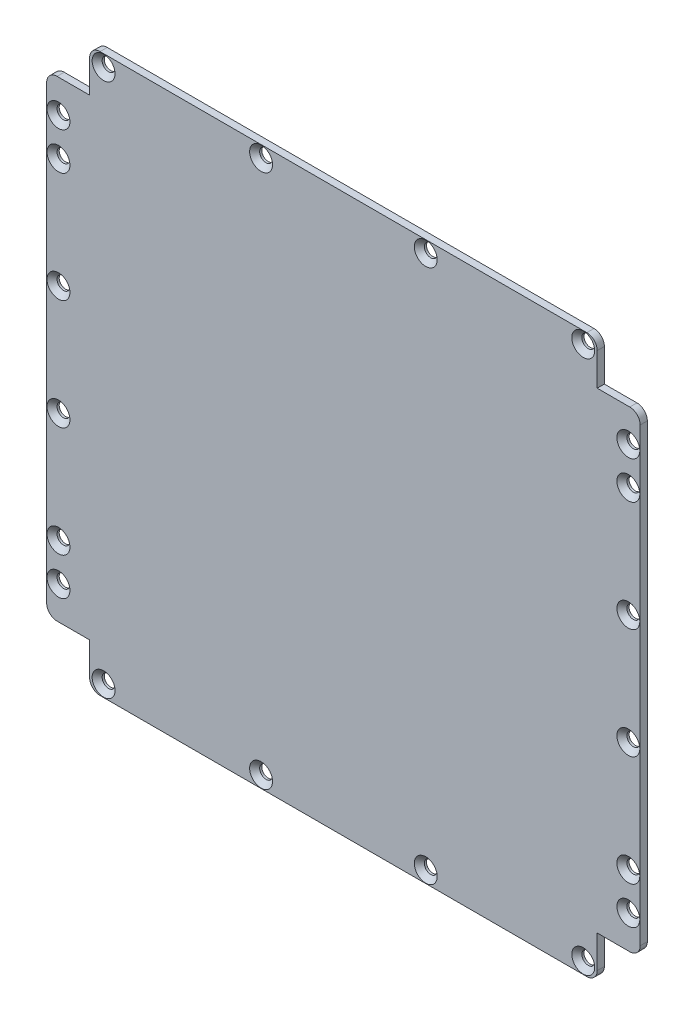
ISO-10303-21;
HEADER;
FILE_DESCRIPTION(('STEP AP214'),'2;1');
FILE_NAME('part.step','',(''),(''),'','','');
FILE_SCHEMA(('AUTOMOTIVE_DESIGN { 1 0 10303 214 1 1 1 1 }'));
ENDSEC;
DATA;
#1=APPLICATION_CONTEXT('core data for automotive mechanical design processes');
#2=APPLICATION_PROTOCOL_DEFINITION('international standard','automotive_design',2000,#1);
#3=PRODUCT_CONTEXT('',#1,'mechanical');
#4=PRODUCT('Part','Part','',(#3));
#5=PRODUCT_RELATED_PRODUCT_CATEGORY('part','',(#4));
#6=PRODUCT_DEFINITION_FORMATION('','',#4);
#7=PRODUCT_DEFINITION_CONTEXT('part definition',#1,'design');
#8=PRODUCT_DEFINITION('design','',#6,#7);
#9=PRODUCT_DEFINITION_SHAPE('','',#8);
#10=(LENGTH_UNIT() NAMED_UNIT(*) SI_UNIT(.MILLI.,.METRE.));
#11=(NAMED_UNIT(*) PLANE_ANGLE_UNIT() SI_UNIT($,.RADIAN.));
#12=(NAMED_UNIT(*) SI_UNIT($,.STERADIAN.) SOLID_ANGLE_UNIT());
#13=UNCERTAINTY_MEASURE_WITH_UNIT(LENGTH_MEASURE(1.E-05),#10,'distance_accuracy_value','');
#14=(GEOMETRIC_REPRESENTATION_CONTEXT(3) GLOBAL_UNCERTAINTY_ASSIGNED_CONTEXT((#13)) GLOBAL_UNIT_ASSIGNED_CONTEXT((#10,
#11,#12)) REPRESENTATION_CONTEXT('',''));
#15=CARTESIAN_POINT('',(0.,0.,0.));
#16=DIRECTION('',(0.,0.,1.));
#17=DIRECTION('',(1.,0.,0.));
#18=AXIS2_PLACEMENT_3D('',#15,#16,#17);
#19=CARTESIAN_POINT('',(408.2731543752,155.924078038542,1.));
#20=DIRECTION('',(0.,0.,-1.));
#21=DIRECTION('',(-1.,0.,0.));
#22=AXIS2_PLACEMENT_3D('',#19,#20,#21);
#23=PLANE('',#22);
#24=CARTESIAN_POINT('',(402.4731543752,95.324078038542,1.));
#25=DIRECTION('',(0.,0.,1.));
#26=DIRECTION('',(1.,0.,0.));
#27=AXIS2_PLACEMENT_3D('',#24,#25,#26);
#28=CIRCLE('',#27,1.59999999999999);
#29=CARTESIAN_POINT('',(404.0731543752,95.324078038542,1.));
#30=VERTEX_POINT('',#29);
#31=EDGE_CURVE('E668',#30,#30,#28,.T.);
#32=ORIENTED_EDGE('',*,*,#31,.F.);
#33=EDGE_LOOP('',(#32));
#34=FACE_BOUND('',#33,.T.);
#35=CARTESIAN_POINT('',(402.473154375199,126.124078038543,1.));
#36=DIRECTION('',(0.,0.,1.));
#37=DIRECTION('',(1.,0.,0.));
#38=AXIS2_PLACEMENT_3D('',#35,#36,#37);
#39=CIRCLE('',#38,1.59999999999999);
#40=CARTESIAN_POINT('',(404.073154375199,126.124078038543,1.));
#41=VERTEX_POINT('',#40);
#42=EDGE_CURVE('E686',#41,#41,#39,.T.);
#43=ORIENTED_EDGE('',*,*,#42,.F.);
#44=EDGE_LOOP('',(#43));
#45=FACE_BOUND('',#44,.T.);
#46=CARTESIAN_POINT('',(402.473154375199,141.524078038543,1.));
#47=DIRECTION('',(0.,0.,1.));
#48=DIRECTION('',(1.,0.,0.));
#49=AXIS2_PLACEMENT_3D('',#46,#47,#48);
#50=CIRCLE('',#49,1.59999999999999);
#51=CARTESIAN_POINT('',(404.073154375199,141.524078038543,1.));
#52=VERTEX_POINT('',#51);
#53=EDGE_CURVE('E695',#52,#52,#50,.T.);
#54=ORIENTED_EDGE('',*,*,#53,.F.);
#55=EDGE_LOOP('',(#54));
#56=FACE_BOUND('',#55,.T.);
#57=CARTESIAN_POINT('',(402.473154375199,146.774078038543,1.));
#58=DIRECTION('',(0.,0.,1.));
#59=DIRECTION('',(1.,0.,0.));
#60=AXIS2_PLACEMENT_3D('',#57,#58,#59);
#61=CIRCLE('',#60,1.59999999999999);
#62=CARTESIAN_POINT('',(404.073154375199,146.774078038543,1.));
#63=VERTEX_POINT('',#62);
#64=EDGE_CURVE('E704',#63,#63,#61,.T.);
#65=ORIENTED_EDGE('',*,*,#64,.F.);
#66=EDGE_LOOP('',(#65));
#67=FACE_BOUND('',#66,.T.);
#68=CARTESIAN_POINT('',(408.2731543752,155.924078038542,1.));
#69=DIRECTION('',(0.,0.,1.));
#70=DIRECTION('',(-1.,0.,0.));
#71=AXIS2_PLACEMENT_3D('',#68,#69,#70);
#72=CIRCLE('',#71,1.44999999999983);
#73=CARTESIAN_POINT('',(408.2731543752,157.374078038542,1.));
#74=VERTEX_POINT('',#73);
#75=CARTESIAN_POINT('',(406.8231543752,155.924078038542,1.));
#76=VERTEX_POINT('',#75);
#77=EDGE_CURVE('E241',#74,#76,#72,.T.);
#78=ORIENTED_EDGE('',*,*,#77,.T.);
#79=DIRECTION('',(1.95204048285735E-13,-1.,0.));
#80=VECTOR('',#79,1.);
#81=CARTESIAN_POINT('',(406.823154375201,151.374078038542,1.));
#82=LINE('',#81,#80);
#83=CARTESIAN_POINT('',(406.823154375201,151.374078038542,1.));
#84=VERTEX_POINT('',#83);
#85=EDGE_CURVE('E129',#76,#84,#82,.T.);
#86=ORIENTED_EDGE('',*,*,#85,.T.);
#87=DIRECTION('',(-1.,0.,0.));
#88=VECTOR('',#87,1.);
#89=CARTESIAN_POINT('',(402.273154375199,151.374078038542,1.));
#90=LINE('',#89,#88);
#91=CARTESIAN_POINT('',(402.273154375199,151.374078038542,1.));
#92=VERTEX_POINT('',#91);
#93=EDGE_CURVE('E292',#84,#92,#90,.T.);
#94=ORIENTED_EDGE('',*,*,#93,.T.);
#95=CARTESIAN_POINT('',(402.273154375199,149.924078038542,1.));
#96=DIRECTION('',(0.,0.,1.));
#97=DIRECTION('',(-1.,0.,0.));
#98=AXIS2_PLACEMENT_3D('',#95,#96,#97);
#99=CIRCLE('',#98,1.44999999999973);
#100=CARTESIAN_POINT('',(400.823154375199,149.924078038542,1.));
#101=VERTEX_POINT('',#100);
#102=EDGE_CURVE('E311',#92,#101,#99,.T.);
#103=ORIENTED_EDGE('',*,*,#102,.T.);
#104=DIRECTION('',(0.,-1.,0.));
#105=VECTOR('',#104,1.);
#106=CARTESIAN_POINT('',(400.823154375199,86.9240780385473,1.));
#107=LINE('',#106,#105);
#108=CARTESIAN_POINT('',(400.823154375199,86.9240780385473,1.));
#109=VERTEX_POINT('',#108);
#110=EDGE_CURVE('E308',#101,#109,#107,.T.);
#111=ORIENTED_EDGE('',*,*,#110,.T.);
#112=CARTESIAN_POINT('',(402.273154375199,86.9240780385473,1.));
#113=DIRECTION('',(0.,0.,1.));
#114=DIRECTION('',(-1.,0.,0.));
#115=AXIS2_PLACEMENT_3D('',#112,#113,#114);
#116=CIRCLE('',#115,1.44999999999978);
#117=CARTESIAN_POINT('',(402.273154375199,85.4740780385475,1.));
#118=VERTEX_POINT('',#117);
#119=EDGE_CURVE('E310',#109,#118,#116,.T.);
#120=ORIENTED_EDGE('',*,*,#119,.T.);
#121=DIRECTION('',(1.,0.,0.));
#122=VECTOR('',#121,1.);
#123=CARTESIAN_POINT('',(406.8231543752,85.4740780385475,1.));
#124=LINE('',#123,#122);
#125=CARTESIAN_POINT('',(406.8231543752,85.4740780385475,1.));
#126=VERTEX_POINT('',#125);
#127=EDGE_CURVE('E313',#118,#126,#124,.T.);
#128=ORIENTED_EDGE('',*,*,#127,.T.);
#129=DIRECTION('',(0.,-1.,0.));
#130=VECTOR('',#129,1.);
#131=CARTESIAN_POINT('',(406.8231543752,80.9240780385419,1.));
#132=LINE('',#131,#130);
#133=CARTESIAN_POINT('',(406.8231543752,80.9240780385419,1.));
#134=VERTEX_POINT('',#133);
#135=EDGE_CURVE('E319',#126,#134,#132,.T.);
#136=ORIENTED_EDGE('',*,*,#135,.T.);
#137=CARTESIAN_POINT('',(408.2731543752,80.9240780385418,1.));
#138=DIRECTION('',(0.,0.,1.));
#139=DIRECTION('',(-1.,0.,0.));
#140=AXIS2_PLACEMENT_3D('',#137,#138,#139);
#141=CIRCLE('',#140,1.44999999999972);
#142=CARTESIAN_POINT('',(408.2731543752,79.4740780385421,1.));
#143=VERTEX_POINT('',#142);
#144=EDGE_CURVE('E321',#134,#143,#141,.T.);
#145=ORIENTED_EDGE('',*,*,#144,.T.);
#146=DIRECTION('',(1.,0.,0.));
#147=VECTOR('',#146,1.);
#148=CARTESIAN_POINT('',(476.273154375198,79.4740780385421,1.));
#149=LINE('',#148,#147);
#150=CARTESIAN_POINT('',(476.273154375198,79.4740780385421,1.));
#151=VERTEX_POINT('',#150);
#152=EDGE_CURVE('E323',#143,#151,#149,.T.);
#153=ORIENTED_EDGE('',*,*,#152,.T.);
#154=CARTESIAN_POINT('',(476.273154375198,80.9240780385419,1.));
#155=DIRECTION('',(0.,0.,1.));
#156=DIRECTION('',(-1.,0.,0.));
#157=AXIS2_PLACEMENT_3D('',#154,#155,#156);
#158=CIRCLE('',#157,1.44999999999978);
#159=CARTESIAN_POINT('',(477.723154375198,80.9240780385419,1.));
#160=VERTEX_POINT('',#159);
#161=EDGE_CURVE('E325',#151,#160,#158,.T.);
#162=ORIENTED_EDGE('',*,*,#161,.T.);
#163=DIRECTION('',(0.,1.,0.));
#164=VECTOR('',#163,1.);
#165=CARTESIAN_POINT('',(477.723154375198,85.474078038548,1.));
#166=LINE('',#165,#164);
#167=CARTESIAN_POINT('',(477.723154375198,85.474078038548,1.));
#168=VERTEX_POINT('',#167);
#169=EDGE_CURVE('E327',#160,#168,#166,.T.);
#170=ORIENTED_EDGE('',*,*,#169,.T.);
#171=DIRECTION('',(1.,-1.00652087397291E-13,0.));
#172=VECTOR('',#171,1.);
#173=CARTESIAN_POINT('',(482.2731543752,85.4740780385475,1.));
#174=LINE('',#173,#172);
#175=CARTESIAN_POINT('',(482.2731543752,85.4740780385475,1.));
#176=VERTEX_POINT('',#175);
#177=EDGE_CURVE('E329',#168,#176,#174,.T.);
#178=ORIENTED_EDGE('',*,*,#177,.T.);
#179=CARTESIAN_POINT('',(482.2731543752,86.9240780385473,1.));
#180=DIRECTION('',(0.,0.,1.));
#181=DIRECTION('',(-1.,0.,0.));
#182=AXIS2_PLACEMENT_3D('',#179,#180,#181);
#183=CIRCLE('',#182,1.44999999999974);
#184=CARTESIAN_POINT('',(483.7231543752,86.9240780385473,1.));
#185=VERTEX_POINT('',#184);
#186=EDGE_CURVE('E331',#176,#185,#183,.T.);
#187=ORIENTED_EDGE('',*,*,#186,.T.);
#188=DIRECTION('',(0.,1.,0.));
#189=VECTOR('',#188,1.);
#190=CARTESIAN_POINT('',(483.723154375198,149.924078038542,1.));
#191=LINE('',#190,#189);
#192=CARTESIAN_POINT('',(483.723154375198,149.924078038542,1.));
#193=VERTEX_POINT('',#192);
#194=EDGE_CURVE('E333',#185,#193,#191,.T.);
#195=ORIENTED_EDGE('',*,*,#194,.T.);
#196=CARTESIAN_POINT('',(482.273154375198,149.924078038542,1.));
#197=DIRECTION('',(0.,0.,1.));
#198=DIRECTION('',(-1.,0.,0.));
#199=AXIS2_PLACEMENT_3D('',#196,#197,#198);
#200=CIRCLE('',#199,1.45000000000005);
#201=CARTESIAN_POINT('',(482.273154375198,151.374078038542,1.));
#202=VERTEX_POINT('',#201);
#203=EDGE_CURVE('E335',#193,#202,#200,.T.);
#204=ORIENTED_EDGE('',*,*,#203,.T.);
#205=DIRECTION('',(-1.,0.,0.));
#206=VECTOR('',#205,1.);
#207=CARTESIAN_POINT('',(477.723154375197,151.374078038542,1.));
#208=LINE('',#207,#206);
#209=CARTESIAN_POINT('',(477.723154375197,151.374078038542,1.));
#210=VERTEX_POINT('',#209);
#211=EDGE_CURVE('E184',#202,#210,#208,.T.);
#212=ORIENTED_EDGE('',*,*,#211,.T.);
#213=DIRECTION('',(1.95204048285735E-13,1.,0.));
#214=VECTOR('',#213,1.);
#215=CARTESIAN_POINT('',(477.723154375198,155.924078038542,1.));
#216=LINE('',#215,#214);
#217=CARTESIAN_POINT('',(477.723154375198,155.924078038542,1.));
#218=VERTEX_POINT('',#217);
#219=EDGE_CURVE('E178',#210,#218,#216,.T.);
#220=ORIENTED_EDGE('',*,*,#219,.T.);
#221=CARTESIAN_POINT('',(476.273154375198,155.924078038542,1.));
#222=DIRECTION('',(0.,0.,1.));
#223=DIRECTION('',(-1.,0.,0.));
#224=AXIS2_PLACEMENT_3D('',#221,#222,#223);
#225=CIRCLE('',#224,1.45000000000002);
#226=CARTESIAN_POINT('',(476.273154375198,157.374078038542,1.));
#227=VERTEX_POINT('',#226);
#228=EDGE_CURVE('E182',#218,#227,#225,.T.);
#229=ORIENTED_EDGE('',*,*,#228,.T.);
#230=DIRECTION('',(-1.,0.,0.));
#231=VECTOR('',#230,1.);
#232=CARTESIAN_POINT('',(408.2731543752,157.374078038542,1.));
#233=LINE('',#232,#231);
#234=EDGE_CURVE('E50',#227,#74,#233,.T.);
#235=ORIENTED_EDGE('',*,*,#234,.T.);
#236=EDGE_LOOP('',(#78,#86,#94,#103,#111,#120,#128,#136,#145,#153,#162,#170,#178,#187,#195,#204,
#212,#220,#229,#235));
#237=FACE_BOUND('',#236,.T.);
#238=CARTESIAN_POINT('',(402.4731543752,110.724078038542,1.));
#239=DIRECTION('',(0.,0.,1.));
#240=DIRECTION('',(1.,0.,0.));
#241=AXIS2_PLACEMENT_3D('',#238,#239,#240);
#242=CIRCLE('',#241,1.59999999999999);
#243=CARTESIAN_POINT('',(404.0731543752,110.724078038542,1.));
#244=VERTEX_POINT('',#243);
#245=EDGE_CURVE('E677',#244,#244,#242,.T.);
#246=ORIENTED_EDGE('',*,*,#245,.F.);
#247=EDGE_LOOP('',(#246));
#248=FACE_BOUND('',#247,.T.);
#249=CARTESIAN_POINT('',(402.473154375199,90.0740780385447,1.));
#250=DIRECTION('',(0.,0.,1.));
#251=DIRECTION('',(1.,0.,0.));
#252=AXIS2_PLACEMENT_3D('',#249,#250,#251);
#253=CIRCLE('',#252,1.59999999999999);
#254=CARTESIAN_POINT('',(404.073154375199,90.0740780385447,1.));
#255=VERTEX_POINT('',#254);
#256=EDGE_CURVE('E659',#255,#255,#253,.T.);
#257=ORIENTED_EDGE('',*,*,#256,.F.);
#258=EDGE_LOOP('',(#257));
#259=FACE_BOUND('',#258,.T.);
#260=CARTESIAN_POINT('',(408.7731543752,81.1240780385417,1.));
#261=DIRECTION('',(0.,0.,1.));
#262=DIRECTION('',(1.,0.,0.));
#263=AXIS2_PLACEMENT_3D('',#260,#261,#262);
#264=CIRCLE('',#263,1.59999999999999);
#265=CARTESIAN_POINT('',(410.3731543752,81.1240780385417,1.));
#266=VERTEX_POINT('',#265);
#267=EDGE_CURVE('E650',#266,#266,#264,.T.);
#268=ORIENTED_EDGE('',*,*,#267,.F.);
#269=EDGE_LOOP('',(#268));
#270=FACE_BOUND('',#269,.T.);
#271=CARTESIAN_POINT('',(430.7731543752,81.1240780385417,1.));
#272=DIRECTION('',(0.,0.,1.));
#273=DIRECTION('',(1.,0.,0.));
#274=AXIS2_PLACEMENT_3D('',#271,#272,#273);
#275=CIRCLE('',#274,1.59999999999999);
#276=CARTESIAN_POINT('',(432.3731543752,81.1240780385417,1.));
#277=VERTEX_POINT('',#276);
#278=EDGE_CURVE('E641',#277,#277,#275,.T.);
#279=ORIENTED_EDGE('',*,*,#278,.F.);
#280=EDGE_LOOP('',(#279));
#281=FACE_BOUND('',#280,.T.);
#282=CARTESIAN_POINT('',(453.773154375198,81.1240780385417,1.));
#283=DIRECTION('',(0.,0.,1.));
#284=DIRECTION('',(1.,0.,0.));
#285=AXIS2_PLACEMENT_3D('',#282,#283,#284);
#286=CIRCLE('',#285,1.59999999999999);
#287=CARTESIAN_POINT('',(455.373154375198,81.1240780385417,1.));
#288=VERTEX_POINT('',#287);
#289=EDGE_CURVE('E632',#288,#288,#286,.T.);
#290=ORIENTED_EDGE('',*,*,#289,.F.);
#291=EDGE_LOOP('',(#290));
#292=FACE_BOUND('',#291,.T.);
#293=CARTESIAN_POINT('',(475.773154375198,81.1240780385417,1.));
#294=DIRECTION('',(0.,0.,1.));
#295=DIRECTION('',(1.,0.,0.));
#296=AXIS2_PLACEMENT_3D('',#293,#294,#295);
#297=CIRCLE('',#296,1.59999999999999);
#298=CARTESIAN_POINT('',(477.373154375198,81.1240780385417,1.));
#299=VERTEX_POINT('',#298);
#300=EDGE_CURVE('E623',#299,#299,#297,.T.);
#301=ORIENTED_EDGE('',*,*,#300,.F.);
#302=EDGE_LOOP('',(#301));
#303=FACE_BOUND('',#302,.T.);
#304=CARTESIAN_POINT('',(482.0731543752,90.0740780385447,1.));
#305=DIRECTION('',(0.,0.,1.));
#306=DIRECTION('',(1.,0.,0.));
#307=AXIS2_PLACEMENT_3D('',#304,#305,#306);
#308=CIRCLE('',#307,1.59999999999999);
#309=CARTESIAN_POINT('',(483.6731543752,90.0740780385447,1.));
#310=VERTEX_POINT('',#309);
#311=EDGE_CURVE('E614',#310,#310,#308,.T.);
#312=ORIENTED_EDGE('',*,*,#311,.F.);
#313=EDGE_LOOP('',(#312));
#314=FACE_BOUND('',#313,.T.);
#315=CARTESIAN_POINT('',(482.0731543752,95.3240780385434,1.));
#316=DIRECTION('',(0.,0.,1.));
#317=DIRECTION('',(1.,0.,0.));
#318=AXIS2_PLACEMENT_3D('',#315,#316,#317);
#319=CIRCLE('',#318,1.59999999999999);
#320=CARTESIAN_POINT('',(483.6731543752,95.3240780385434,1.));
#321=VERTEX_POINT('',#320);
#322=EDGE_CURVE('E605',#321,#321,#319,.T.);
#323=ORIENTED_EDGE('',*,*,#322,.F.);
#324=EDGE_LOOP('',(#323));
#325=FACE_BOUND('',#324,.T.);
#326=CARTESIAN_POINT('',(482.0731543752,110.724078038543,1.));
#327=DIRECTION('',(0.,0.,1.));
#328=DIRECTION('',(1.,0.,0.));
#329=AXIS2_PLACEMENT_3D('',#326,#327,#328);
#330=CIRCLE('',#329,1.59999999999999);
#331=CARTESIAN_POINT('',(483.6731543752,110.724078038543,1.));
#332=VERTEX_POINT('',#331);
#333=EDGE_CURVE('E596',#332,#332,#330,.T.);
#334=ORIENTED_EDGE('',*,*,#333,.F.);
#335=EDGE_LOOP('',(#334));
#336=FACE_BOUND('',#335,.T.);
#337=CARTESIAN_POINT('',(482.073154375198,126.124078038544,1.));
#338=DIRECTION('',(0.,0.,1.));
#339=DIRECTION('',(1.,0.,0.));
#340=AXIS2_PLACEMENT_3D('',#337,#338,#339);
#341=CIRCLE('',#340,1.59999999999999);
#342=CARTESIAN_POINT('',(483.673154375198,126.124078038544,1.));
#343=VERTEX_POINT('',#342);
#344=EDGE_CURVE('E587',#343,#343,#341,.T.);
#345=ORIENTED_EDGE('',*,*,#344,.F.);
#346=EDGE_LOOP('',(#345));
#347=FACE_BOUND('',#346,.T.);
#348=CARTESIAN_POINT('',(482.073154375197,141.524078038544,1.));
#349=DIRECTION('',(0.,0.,1.));
#350=DIRECTION('',(1.,0.,0.));
#351=AXIS2_PLACEMENT_3D('',#348,#349,#350);
#352=CIRCLE('',#351,1.59999999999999);
#353=CARTESIAN_POINT('',(483.673154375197,141.524078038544,1.));
#354=VERTEX_POINT('',#353);
#355=EDGE_CURVE('E578',#354,#354,#352,.T.);
#356=ORIENTED_EDGE('',*,*,#355,.F.);
#357=EDGE_LOOP('',(#356));
#358=FACE_BOUND('',#357,.T.);
#359=CARTESIAN_POINT('',(482.073154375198,146.774078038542,1.));
#360=DIRECTION('',(0.,0.,1.));
#361=DIRECTION('',(1.,0.,0.));
#362=AXIS2_PLACEMENT_3D('',#359,#360,#361);
#363=CIRCLE('',#362,1.59999999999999);
#364=CARTESIAN_POINT('',(483.673154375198,146.774078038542,1.));
#365=VERTEX_POINT('',#364);
#366=EDGE_CURVE('E569',#365,#365,#363,.T.);
#367=ORIENTED_EDGE('',*,*,#366,.F.);
#368=EDGE_LOOP('',(#367));
#369=FACE_BOUND('',#368,.T.);
#370=CARTESIAN_POINT('',(475.773154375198,155.724078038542,1.));
#371=DIRECTION('',(0.,0.,1.));
#372=DIRECTION('',(1.,0.,0.));
#373=AXIS2_PLACEMENT_3D('',#370,#371,#372);
#374=CIRCLE('',#373,1.59999999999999);
#375=CARTESIAN_POINT('',(477.373154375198,155.724078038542,1.));
#376=VERTEX_POINT('',#375);
#377=EDGE_CURVE('E560',#376,#376,#374,.T.);
#378=ORIENTED_EDGE('',*,*,#377,.F.);
#379=EDGE_LOOP('',(#378));
#380=FACE_BOUND('',#379,.T.);
#381=CARTESIAN_POINT('',(453.773154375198,155.724078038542,1.));
#382=DIRECTION('',(0.,0.,1.));
#383=DIRECTION('',(1.,0.,0.));
#384=AXIS2_PLACEMENT_3D('',#381,#382,#383);
#385=CIRCLE('',#384,1.59999999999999);
#386=CARTESIAN_POINT('',(455.373154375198,155.724078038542,1.));
#387=VERTEX_POINT('',#386);
#388=EDGE_CURVE('E551',#387,#387,#385,.T.);
#389=ORIENTED_EDGE('',*,*,#388,.F.);
#390=EDGE_LOOP('',(#389));
#391=FACE_BOUND('',#390,.T.);
#392=CARTESIAN_POINT('',(430.7731543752,155.724078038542,1.));
#393=DIRECTION('',(0.,0.,1.));
#394=DIRECTION('',(1.,0.,0.));
#395=AXIS2_PLACEMENT_3D('',#392,#393,#394);
#396=CIRCLE('',#395,1.59999999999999);
#397=CARTESIAN_POINT('',(432.3731543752,155.724078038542,1.));
#398=VERTEX_POINT('',#397);
#399=EDGE_CURVE('E542',#398,#398,#396,.T.);
#400=ORIENTED_EDGE('',*,*,#399,.F.);
#401=EDGE_LOOP('',(#400));
#402=FACE_BOUND('',#401,.T.);
#403=CARTESIAN_POINT('',(408.7731543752,155.724078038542,1.));
#404=DIRECTION('',(0.,0.,1.));
#405=DIRECTION('',(1.,0.,0.));
#406=AXIS2_PLACEMENT_3D('',#403,#404,#405);
#407=CIRCLE('',#406,1.59999999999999);
#408=CARTESIAN_POINT('',(410.3731543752,155.724078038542,1.));
#409=VERTEX_POINT('',#408);
#410=EDGE_CURVE('E534',#409,#409,#407,.T.);
#411=ORIENTED_EDGE('',*,*,#410,.F.);
#412=EDGE_LOOP('',(#411));
#413=FACE_BOUND('',#412,.T.);
#414=ADVANCED_FACE('F33',(#34,#45,#56,#67,#237,#248,#259,#270,#281,#292,#303,#314,#325,#336,
#347,#358,#369,#380,#391,#402,#413),#23,.F.);
#415=CARTESIAN_POINT('',(408.2731543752,155.924078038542,0.));
#416=DIRECTION('',(0.,0.,-1.));
#417=DIRECTION('',(-1.,0.,0.));
#418=AXIS2_PLACEMENT_3D('',#415,#416,#417);
#419=PLANE('',#418);
#420=CARTESIAN_POINT('',(408.7731543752,155.724078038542,0.));
#421=DIRECTION('',(0.,0.,1.));
#422=DIRECTION('',(1.,0.,0.));
#423=AXIS2_PLACEMENT_3D('',#420,#421,#422);
#424=CIRCLE('',#423,0.900000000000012);
#425=CARTESIAN_POINT('',(409.6731543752,155.724078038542,0.));
#426=VERTEX_POINT('',#425);
#427=EDGE_CURVE('E537',#426,#426,#424,.T.);
#428=ORIENTED_EDGE('',*,*,#427,.T.);
#429=EDGE_LOOP('',(#428));
#430=FACE_BOUND('',#429,.T.);
#431=CARTESIAN_POINT('',(430.7731543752,155.724078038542,0.));
#432=DIRECTION('',(0.,0.,1.));
#433=DIRECTION('',(1.,0.,0.));
#434=AXIS2_PLACEMENT_3D('',#431,#432,#433);
#435=CIRCLE('',#434,0.900000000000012);
#436=CARTESIAN_POINT('',(431.6731543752,155.724078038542,0.));
#437=VERTEX_POINT('',#436);
#438=EDGE_CURVE('E548',#437,#437,#435,.T.);
#439=ORIENTED_EDGE('',*,*,#438,.T.);
#440=EDGE_LOOP('',(#439));
#441=FACE_BOUND('',#440,.T.);
#442=CARTESIAN_POINT('',(453.773154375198,155.724078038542,0.));
#443=DIRECTION('',(0.,0.,1.));
#444=DIRECTION('',(1.,0.,0.));
#445=AXIS2_PLACEMENT_3D('',#442,#443,#444);
#446=CIRCLE('',#445,0.900000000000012);
#447=CARTESIAN_POINT('',(454.673154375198,155.724078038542,0.));
#448=VERTEX_POINT('',#447);
#449=EDGE_CURVE('E557',#448,#448,#446,.T.);
#450=ORIENTED_EDGE('',*,*,#449,.T.);
#451=EDGE_LOOP('',(#450));
#452=FACE_BOUND('',#451,.T.);
#453=CARTESIAN_POINT('',(475.773154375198,155.724078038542,0.));
#454=DIRECTION('',(0.,0.,1.));
#455=DIRECTION('',(1.,0.,0.));
#456=AXIS2_PLACEMENT_3D('',#453,#454,#455);
#457=CIRCLE('',#456,0.900000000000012);
#458=CARTESIAN_POINT('',(476.673154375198,155.724078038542,0.));
#459=VERTEX_POINT('',#458);
#460=EDGE_CURVE('E566',#459,#459,#457,.T.);
#461=ORIENTED_EDGE('',*,*,#460,.T.);
#462=EDGE_LOOP('',(#461));
#463=FACE_BOUND('',#462,.T.);
#464=CARTESIAN_POINT('',(482.073154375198,146.774078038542,0.));
#465=DIRECTION('',(0.,0.,1.));
#466=DIRECTION('',(1.,0.,0.));
#467=AXIS2_PLACEMENT_3D('',#464,#465,#466);
#468=CIRCLE('',#467,0.900000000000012);
#469=CARTESIAN_POINT('',(482.973154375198,146.774078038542,0.));
#470=VERTEX_POINT('',#469);
#471=EDGE_CURVE('E575',#470,#470,#468,.T.);
#472=ORIENTED_EDGE('',*,*,#471,.T.);
#473=EDGE_LOOP('',(#472));
#474=FACE_BOUND('',#473,.T.);
#475=CARTESIAN_POINT('',(482.0731543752,90.0740780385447,0.));
#476=DIRECTION('',(0.,0.,1.));
#477=DIRECTION('',(1.,0.,0.));
#478=AXIS2_PLACEMENT_3D('',#475,#476,#477);
#479=CIRCLE('',#478,0.900000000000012);
#480=CARTESIAN_POINT('',(482.9731543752,90.0740780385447,0.));
#481=VERTEX_POINT('',#480);
#482=EDGE_CURVE('E620',#481,#481,#479,.T.);
#483=ORIENTED_EDGE('',*,*,#482,.T.);
#484=EDGE_LOOP('',(#483));
#485=FACE_BOUND('',#484,.T.);
#486=CARTESIAN_POINT('',(475.773154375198,81.1240780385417,0.));
#487=DIRECTION('',(0.,0.,1.));
#488=DIRECTION('',(1.,0.,0.));
#489=AXIS2_PLACEMENT_3D('',#486,#487,#488);
#490=CIRCLE('',#489,0.900000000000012);
#491=CARTESIAN_POINT('',(476.673154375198,81.1240780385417,0.));
#492=VERTEX_POINT('',#491);
#493=EDGE_CURVE('E629',#492,#492,#490,.T.);
#494=ORIENTED_EDGE('',*,*,#493,.T.);
#495=EDGE_LOOP('',(#494));
#496=FACE_BOUND('',#495,.T.);
#497=CARTESIAN_POINT('',(453.773154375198,81.1240780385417,0.));
#498=DIRECTION('',(0.,0.,1.));
#499=DIRECTION('',(1.,0.,0.));
#500=AXIS2_PLACEMENT_3D('',#497,#498,#499);
#501=CIRCLE('',#500,0.900000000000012);
#502=CARTESIAN_POINT('',(454.673154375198,81.1240780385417,0.));
#503=VERTEX_POINT('',#502);
#504=EDGE_CURVE('E638',#503,#503,#501,.T.);
#505=ORIENTED_EDGE('',*,*,#504,.T.);
#506=EDGE_LOOP('',(#505));
#507=FACE_BOUND('',#506,.T.);
#508=CARTESIAN_POINT('',(430.7731543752,81.1240780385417,0.));
#509=DIRECTION('',(0.,0.,1.));
#510=DIRECTION('',(1.,0.,0.));
#511=AXIS2_PLACEMENT_3D('',#508,#509,#510);
#512=CIRCLE('',#511,0.900000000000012);
#513=CARTESIAN_POINT('',(431.6731543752,81.1240780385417,0.));
#514=VERTEX_POINT('',#513);
#515=EDGE_CURVE('E647',#514,#514,#512,.T.);
#516=ORIENTED_EDGE('',*,*,#515,.T.);
#517=EDGE_LOOP('',(#516));
#518=FACE_BOUND('',#517,.T.);
#519=CARTESIAN_POINT('',(408.7731543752,81.1240780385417,0.));
#520=DIRECTION('',(0.,0.,1.));
#521=DIRECTION('',(1.,0.,0.));
#522=AXIS2_PLACEMENT_3D('',#519,#520,#521);
#523=CIRCLE('',#522,0.900000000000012);
#524=CARTESIAN_POINT('',(409.6731543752,81.1240780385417,0.));
#525=VERTEX_POINT('',#524);
#526=EDGE_CURVE('E656',#525,#525,#523,.T.);
#527=ORIENTED_EDGE('',*,*,#526,.T.);
#528=EDGE_LOOP('',(#527));
#529=FACE_BOUND('',#528,.T.);
#530=CARTESIAN_POINT('',(402.473154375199,90.0740780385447,0.));
#531=DIRECTION('',(0.,0.,1.));
#532=DIRECTION('',(1.,0.,0.));
#533=AXIS2_PLACEMENT_3D('',#530,#531,#532);
#534=CIRCLE('',#533,0.900000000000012);
#535=CARTESIAN_POINT('',(403.373154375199,90.0740780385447,0.));
#536=VERTEX_POINT('',#535);
#537=EDGE_CURVE('E665',#536,#536,#534,.T.);
#538=ORIENTED_EDGE('',*,*,#537,.T.);
#539=EDGE_LOOP('',(#538));
#540=FACE_BOUND('',#539,.T.);
#541=CARTESIAN_POINT('',(402.4731543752,95.324078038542,0.));
#542=DIRECTION('',(0.,0.,1.));
#543=DIRECTION('',(1.,0.,0.));
#544=AXIS2_PLACEMENT_3D('',#541,#542,#543);
#545=CIRCLE('',#544,0.900000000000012);
#546=CARTESIAN_POINT('',(403.3731543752,95.324078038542,0.));
#547=VERTEX_POINT('',#546);
#548=EDGE_CURVE('E674',#547,#547,#545,.T.);
#549=ORIENTED_EDGE('',*,*,#548,.T.);
#550=EDGE_LOOP('',(#549));
#551=FACE_BOUND('',#550,.T.);
#552=CARTESIAN_POINT('',(402.4731543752,110.724078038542,0.));
#553=DIRECTION('',(0.,0.,1.));
#554=DIRECTION('',(1.,0.,0.));
#555=AXIS2_PLACEMENT_3D('',#552,#553,#554);
#556=CIRCLE('',#555,0.900000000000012);
#557=CARTESIAN_POINT('',(403.3731543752,110.724078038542,0.));
#558=VERTEX_POINT('',#557);
#559=EDGE_CURVE('E683',#558,#558,#556,.T.);
#560=ORIENTED_EDGE('',*,*,#559,.T.);
#561=EDGE_LOOP('',(#560));
#562=FACE_BOUND('',#561,.T.);
#563=CARTESIAN_POINT('',(408.2731543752,155.924078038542,0.));
#564=DIRECTION('',(0.,0.,1.));
#565=DIRECTION('',(-1.,0.,0.));
#566=AXIS2_PLACEMENT_3D('',#563,#564,#565);
#567=CIRCLE('',#566,1.44999999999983);
#568=CARTESIAN_POINT('',(408.2731543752,157.374078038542,0.));
#569=VERTEX_POINT('',#568);
#570=CARTESIAN_POINT('',(406.8231543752,155.924078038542,0.));
#571=VERTEX_POINT('',#570);
#572=EDGE_CURVE('E202',#569,#571,#567,.T.);
#573=ORIENTED_EDGE('',*,*,#572,.F.);
#574=DIRECTION('',(-1.,0.,0.));
#575=VECTOR('',#574,1.);
#576=CARTESIAN_POINT('',(408.2731543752,157.374078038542,0.));
#577=LINE('',#576,#575);
#578=CARTESIAN_POINT('',(476.273154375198,157.374078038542,0.));
#579=VERTEX_POINT('',#578);
#580=EDGE_CURVE('E121',#579,#569,#577,.T.);
#581=ORIENTED_EDGE('',*,*,#580,.F.);
#582=CARTESIAN_POINT('',(476.273154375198,155.924078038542,0.));
#583=DIRECTION('',(0.,0.,1.));
#584=DIRECTION('',(-1.,0.,0.));
#585=AXIS2_PLACEMENT_3D('',#582,#583,#584);
#586=CIRCLE('',#585,1.45000000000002);
#587=CARTESIAN_POINT('',(477.723154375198,155.924078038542,0.));
#588=VERTEX_POINT('',#587);
#589=EDGE_CURVE('E115',#588,#579,#586,.T.);
#590=ORIENTED_EDGE('',*,*,#589,.F.);
#591=DIRECTION('',(1.95204048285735E-13,1.,0.));
#592=VECTOR('',#591,1.);
#593=CARTESIAN_POINT('',(477.723154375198,155.924078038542,0.));
#594=LINE('',#593,#592);
#595=CARTESIAN_POINT('',(477.723154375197,151.374078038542,0.));
#596=VERTEX_POINT('',#595);
#597=EDGE_CURVE('E192',#596,#588,#594,.T.);
#598=ORIENTED_EDGE('',*,*,#597,.F.);
#599=DIRECTION('',(-1.,0.,0.));
#600=VECTOR('',#599,1.);
#601=CARTESIAN_POINT('',(477.723154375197,151.374078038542,0.));
#602=LINE('',#601,#600);
#603=CARTESIAN_POINT('',(482.273154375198,151.374078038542,0.));
#604=VERTEX_POINT('',#603);
#605=EDGE_CURVE('E236',#604,#596,#602,.T.);
#606=ORIENTED_EDGE('',*,*,#605,.F.);
#607=CARTESIAN_POINT('',(482.273154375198,149.924078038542,0.));
#608=DIRECTION('',(0.,0.,1.));
#609=DIRECTION('',(-1.,0.,0.));
#610=AXIS2_PLACEMENT_3D('',#607,#608,#609);
#611=CIRCLE('',#610,1.45000000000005);
#612=CARTESIAN_POINT('',(483.723154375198,149.924078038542,0.));
#613=VERTEX_POINT('',#612);
#614=EDGE_CURVE('E234',#613,#604,#611,.T.);
#615=ORIENTED_EDGE('',*,*,#614,.F.);
#616=DIRECTION('',(0.,1.,0.));
#617=VECTOR('',#616,1.);
#618=CARTESIAN_POINT('',(483.723154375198,149.924078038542,0.));
#619=LINE('',#618,#617);
#620=CARTESIAN_POINT('',(483.7231543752,86.9240780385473,0.));
#621=VERTEX_POINT('',#620);
#622=EDGE_CURVE('E232',#621,#613,#619,.T.);
#623=ORIENTED_EDGE('',*,*,#622,.F.);
#624=CARTESIAN_POINT('',(482.2731543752,86.9240780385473,0.));
#625=DIRECTION('',(0.,0.,1.));
#626=DIRECTION('',(-1.,0.,0.));
#627=AXIS2_PLACEMENT_3D('',#624,#625,#626);
#628=CIRCLE('',#627,1.44999999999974);
#629=CARTESIAN_POINT('',(482.2731543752,85.4740780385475,0.));
#630=VERTEX_POINT('',#629);
#631=EDGE_CURVE('E230',#630,#621,#628,.T.);
#632=ORIENTED_EDGE('',*,*,#631,.F.);
#633=DIRECTION('',(1.,-1.00652087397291E-13,0.));
#634=VECTOR('',#633,1.);
#635=CARTESIAN_POINT('',(482.2731543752,85.4740780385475,0.));
#636=LINE('',#635,#634);
#637=CARTESIAN_POINT('',(477.723154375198,85.474078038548,0.));
#638=VERTEX_POINT('',#637);
#639=EDGE_CURVE('E228',#638,#630,#636,.T.);
#640=ORIENTED_EDGE('',*,*,#639,.F.);
#641=DIRECTION('',(0.,1.,0.));
#642=VECTOR('',#641,1.);
#643=CARTESIAN_POINT('',(477.723154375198,85.474078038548,0.));
#644=LINE('',#643,#642);
#645=CARTESIAN_POINT('',(477.723154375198,80.9240780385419,0.));
#646=VERTEX_POINT('',#645);
#647=EDGE_CURVE('E226',#646,#638,#644,.T.);
#648=ORIENTED_EDGE('',*,*,#647,.F.);
#649=CARTESIAN_POINT('',(476.273154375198,80.9240780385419,0.));
#650=DIRECTION('',(0.,0.,1.));
#651=DIRECTION('',(-1.,0.,0.));
#652=AXIS2_PLACEMENT_3D('',#649,#650,#651);
#653=CIRCLE('',#652,1.44999999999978);
#654=CARTESIAN_POINT('',(476.273154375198,79.4740780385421,0.));
#655=VERTEX_POINT('',#654);
#656=EDGE_CURVE('E224',#655,#646,#653,.T.);
#657=ORIENTED_EDGE('',*,*,#656,.F.);
#658=DIRECTION('',(1.,0.,0.));
#659=VECTOR('',#658,1.);
#660=CARTESIAN_POINT('',(476.273154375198,79.4740780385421,0.));
#661=LINE('',#660,#659);
#662=CARTESIAN_POINT('',(408.2731543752,79.4740780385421,0.));
#663=VERTEX_POINT('',#662);
#664=EDGE_CURVE('E222',#663,#655,#661,.T.);
#665=ORIENTED_EDGE('',*,*,#664,.F.);
#666=CARTESIAN_POINT('',(408.2731543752,80.9240780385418,0.));
#667=DIRECTION('',(0.,0.,1.));
#668=DIRECTION('',(-1.,0.,0.));
#669=AXIS2_PLACEMENT_3D('',#666,#667,#668);
#670=CIRCLE('',#669,1.44999999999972);
#671=CARTESIAN_POINT('',(406.8231543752,80.9240780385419,0.));
#672=VERTEX_POINT('',#671);
#673=EDGE_CURVE('E220',#672,#663,#670,.T.);
#674=ORIENTED_EDGE('',*,*,#673,.F.);
#675=DIRECTION('',(0.,-1.,0.));
#676=VECTOR('',#675,1.);
#677=CARTESIAN_POINT('',(406.8231543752,80.9240780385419,0.));
#678=LINE('',#677,#676);
#679=CARTESIAN_POINT('',(406.8231543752,85.4740780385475,0.));
#680=VERTEX_POINT('',#679);
#681=EDGE_CURVE('E218',#680,#672,#678,.T.);
#682=ORIENTED_EDGE('',*,*,#681,.F.);
#683=DIRECTION('',(1.,0.,0.));
#684=VECTOR('',#683,1.);
#685=CARTESIAN_POINT('',(406.8231543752,85.4740780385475,0.));
#686=LINE('',#685,#684);
#687=CARTESIAN_POINT('',(402.273154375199,85.4740780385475,0.));
#688=VERTEX_POINT('',#687);
#689=EDGE_CURVE('E216',#688,#680,#686,.T.);
#690=ORIENTED_EDGE('',*,*,#689,.F.);
#691=CARTESIAN_POINT('',(402.273154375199,86.9240780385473,0.));
#692=DIRECTION('',(0.,0.,1.));
#693=DIRECTION('',(-1.,0.,0.));
#694=AXIS2_PLACEMENT_3D('',#691,#692,#693);
#695=CIRCLE('',#694,1.44999999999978);
#696=CARTESIAN_POINT('',(400.823154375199,86.9240780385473,0.));
#697=VERTEX_POINT('',#696);
#698=EDGE_CURVE('E214',#697,#688,#695,.T.);
#699=ORIENTED_EDGE('',*,*,#698,.F.);
#700=DIRECTION('',(0.,-1.,0.));
#701=VECTOR('',#700,1.);
#702=CARTESIAN_POINT('',(400.823154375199,86.9240780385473,0.));
#703=LINE('',#702,#701);
#704=CARTESIAN_POINT('',(400.823154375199,149.924078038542,0.));
#705=VERTEX_POINT('',#704);
#706=EDGE_CURVE('E212',#705,#697,#703,.T.);
#707=ORIENTED_EDGE('',*,*,#706,.F.);
#708=CARTESIAN_POINT('',(402.273154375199,149.924078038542,0.));
#709=DIRECTION('',(0.,0.,1.));
#710=DIRECTION('',(-1.,0.,0.));
#711=AXIS2_PLACEMENT_3D('',#708,#709,#710);
#712=CIRCLE('',#711,1.44999999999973);
#713=CARTESIAN_POINT('',(402.273154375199,151.374078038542,0.));
#714=VERTEX_POINT('',#713);
#715=EDGE_CURVE('E210',#714,#705,#712,.T.);
#716=ORIENTED_EDGE('',*,*,#715,.F.);
#717=DIRECTION('',(-1.,0.,0.));
#718=VECTOR('',#717,1.);
#719=CARTESIAN_POINT('',(402.273154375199,151.374078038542,0.));
#720=LINE('',#719,#718);
#721=CARTESIAN_POINT('',(406.823154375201,151.374078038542,0.));
#722=VERTEX_POINT('',#721);
#723=EDGE_CURVE('E208',#722,#714,#720,.T.);
#724=ORIENTED_EDGE('',*,*,#723,.F.);
#725=DIRECTION('',(1.95204048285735E-13,-1.,0.));
#726=VECTOR('',#725,1.);
#727=CARTESIAN_POINT('',(406.823154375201,151.374078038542,0.));
#728=LINE('',#727,#726);
#729=EDGE_CURVE('E205',#571,#722,#728,.T.);
#730=ORIENTED_EDGE('',*,*,#729,.F.);
#731=EDGE_LOOP('',(#573,#581,#590,#598,#606,#615,#623,#632,#640,#648,#657,#665,#674,#682,#690,
#699,#707,#716,#724,#730));
#732=FACE_BOUND('',#731,.T.);
#733=CARTESIAN_POINT('',(402.473154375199,146.774078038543,0.));
#734=DIRECTION('',(0.,0.,1.));
#735=DIRECTION('',(1.,0.,0.));
#736=AXIS2_PLACEMENT_3D('',#733,#734,#735);
#737=CIRCLE('',#736,0.900000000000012);
#738=CARTESIAN_POINT('',(403.373154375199,146.774078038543,0.));
#739=VERTEX_POINT('',#738);
#740=EDGE_CURVE('E206',#739,#739,#737,.T.);
#741=ORIENTED_EDGE('',*,*,#740,.T.);
#742=EDGE_LOOP('',(#741));
#743=FACE_BOUND('',#742,.T.);
#744=CARTESIAN_POINT('',(402.473154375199,141.524078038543,0.));
#745=DIRECTION('',(0.,0.,1.));
#746=DIRECTION('',(1.,0.,0.));
#747=AXIS2_PLACEMENT_3D('',#744,#745,#746);
#748=CIRCLE('',#747,0.900000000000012);
#749=CARTESIAN_POINT('',(403.373154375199,141.524078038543,0.));
#750=VERTEX_POINT('',#749);
#751=EDGE_CURVE('E701',#750,#750,#748,.T.);
#752=ORIENTED_EDGE('',*,*,#751,.T.);
#753=EDGE_LOOP('',(#752));
#754=FACE_BOUND('',#753,.T.);
#755=CARTESIAN_POINT('',(402.473154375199,126.124078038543,0.));
#756=DIRECTION('',(0.,0.,1.));
#757=DIRECTION('',(1.,0.,0.));
#758=AXIS2_PLACEMENT_3D('',#755,#756,#757);
#759=CIRCLE('',#758,0.900000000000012);
#760=CARTESIAN_POINT('',(403.373154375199,126.124078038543,0.));
#761=VERTEX_POINT('',#760);
#762=EDGE_CURVE('E692',#761,#761,#759,.T.);
#763=ORIENTED_EDGE('',*,*,#762,.T.);
#764=EDGE_LOOP('',(#763));
#765=FACE_BOUND('',#764,.T.);
#766=CARTESIAN_POINT('',(482.0731543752,95.3240780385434,0.));
#767=DIRECTION('',(0.,0.,1.));
#768=DIRECTION('',(1.,0.,0.));
#769=AXIS2_PLACEMENT_3D('',#766,#767,#768);
#770=CIRCLE('',#769,0.900000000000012);
#771=CARTESIAN_POINT('',(482.9731543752,95.3240780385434,0.));
#772=VERTEX_POINT('',#771);
#773=EDGE_CURVE('E611',#772,#772,#770,.T.);
#774=ORIENTED_EDGE('',*,*,#773,.T.);
#775=EDGE_LOOP('',(#774));
#776=FACE_BOUND('',#775,.T.);
#777=CARTESIAN_POINT('',(482.0731543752,110.724078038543,0.));
#778=DIRECTION('',(0.,0.,1.));
#779=DIRECTION('',(1.,0.,0.));
#780=AXIS2_PLACEMENT_3D('',#777,#778,#779);
#781=CIRCLE('',#780,0.900000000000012);
#782=CARTESIAN_POINT('',(482.9731543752,110.724078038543,0.));
#783=VERTEX_POINT('',#782);
#784=EDGE_CURVE('E602',#783,#783,#781,.T.);
#785=ORIENTED_EDGE('',*,*,#784,.T.);
#786=EDGE_LOOP('',(#785));
#787=FACE_BOUND('',#786,.T.);
#788=CARTESIAN_POINT('',(482.073154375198,126.124078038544,0.));
#789=DIRECTION('',(0.,0.,1.));
#790=DIRECTION('',(1.,0.,0.));
#791=AXIS2_PLACEMENT_3D('',#788,#789,#790);
#792=CIRCLE('',#791,0.900000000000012);
#793=CARTESIAN_POINT('',(482.973154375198,126.124078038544,0.));
#794=VERTEX_POINT('',#793);
#795=EDGE_CURVE('E593',#794,#794,#792,.T.);
#796=ORIENTED_EDGE('',*,*,#795,.T.);
#797=EDGE_LOOP('',(#796));
#798=FACE_BOUND('',#797,.T.);
#799=CARTESIAN_POINT('',(482.073154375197,141.524078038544,0.));
#800=DIRECTION('',(0.,0.,1.));
#801=DIRECTION('',(1.,0.,0.));
#802=AXIS2_PLACEMENT_3D('',#799,#800,#801);
#803=CIRCLE('',#802,0.900000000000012);
#804=CARTESIAN_POINT('',(482.973154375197,141.524078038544,0.));
#805=VERTEX_POINT('',#804);
#806=EDGE_CURVE('E584',#805,#805,#803,.T.);
#807=ORIENTED_EDGE('',*,*,#806,.T.);
#808=EDGE_LOOP('',(#807));
#809=FACE_BOUND('',#808,.T.);
#810=ADVANCED_FACE('F296',(#430,#441,#452,#463,#474,#485,#496,#507,#518,#529,#540,#551,#562,
#732,#743,#754,#765,#776,#787,#798,#809),#419,.T.);
#811=CARTESIAN_POINT('',(408.2731543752,155.924078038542,1.));
#812=DIRECTION('',(0.,0.,-1.));
#813=DIRECTION('',(-1.,0.,0.));
#814=AXIS2_PLACEMENT_3D('',#811,#812,#813);
#815=CYLINDRICAL_SURFACE('',#814,1.44999999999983);
#816=ORIENTED_EDGE('',*,*,#572,.T.);
#817=DIRECTION('',(0.,0.,-1.));
#818=VECTOR('',#817,1.);
#819=CARTESIAN_POINT('',(406.8231543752,155.924078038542,1.));
#820=LINE('',#819,#818);
#821=EDGE_CURVE('E11',#76,#571,#820,.T.);
#822=ORIENTED_EDGE('',*,*,#821,.F.);
#823=ORIENTED_EDGE('',*,*,#77,.F.);
#824=DIRECTION('',(0.,0.,-1.));
#825=VECTOR('',#824,1.);
#826=CARTESIAN_POINT('',(408.2731543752,157.374078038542,1.));
#827=LINE('',#826,#825);
#828=EDGE_CURVE('E198',#74,#569,#827,.T.);
#829=ORIENTED_EDGE('',*,*,#828,.T.);
#830=EDGE_LOOP('',(#816,#822,#823,#829));
#831=FACE_BOUND('',#830,.T.);
#832=ADVANCED_FACE('F35',(#831),#815,.T.);
#833=CARTESIAN_POINT('',(406.823154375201,151.374078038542,1.));
#834=DIRECTION('',(1.,1.95204048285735E-13,0.));
#835=DIRECTION('',(-1.95204048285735E-13,1.,0.));
#836=AXIS2_PLACEMENT_3D('',#833,#834,#835);
#837=PLANE('',#836);
#838=ORIENTED_EDGE('',*,*,#729,.T.);
#839=DIRECTION('',(0.,0.,-1.));
#840=VECTOR('',#839,1.);
#841=CARTESIAN_POINT('',(406.823154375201,151.374078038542,1.));
#842=LINE('',#841,#840);
#843=EDGE_CURVE('E42',#84,#722,#842,.T.);
#844=ORIENTED_EDGE('',*,*,#843,.F.);
#845=ORIENTED_EDGE('',*,*,#85,.F.);
#846=ORIENTED_EDGE('',*,*,#821,.T.);
#847=EDGE_LOOP('',(#838,#844,#845,#846));
#848=FACE_BOUND('',#847,.T.);
#849=ADVANCED_FACE('F1169',(#848),#837,.F.);
#850=CARTESIAN_POINT('',(402.273154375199,151.374078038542,1.));
#851=DIRECTION('',(0.,-1.,0.));
#852=DIRECTION('',(0.,0.,-1.));
#853=AXIS2_PLACEMENT_3D('',#850,#851,#852);
#854=PLANE('',#853);
#855=ORIENTED_EDGE('',*,*,#723,.T.);
#856=DIRECTION('',(0.,0.,-1.));
#857=VECTOR('',#856,1.);
#858=CARTESIAN_POINT('',(402.273154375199,151.374078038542,1.));
#859=LINE('',#858,#857);
#860=EDGE_CURVE('E284',#92,#714,#859,.T.);
#861=ORIENTED_EDGE('',*,*,#860,.F.);
#862=ORIENTED_EDGE('',*,*,#93,.F.);
#863=ORIENTED_EDGE('',*,*,#843,.T.);
#864=EDGE_LOOP('',(#855,#861,#862,#863));
#865=FACE_BOUND('',#864,.T.);
#866=ADVANCED_FACE('F290',(#865),#854,.F.);
#867=CARTESIAN_POINT('',(402.273154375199,149.924078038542,1.));
#868=DIRECTION('',(0.,0.,-1.));
#869=DIRECTION('',(-1.,0.,0.));
#870=AXIS2_PLACEMENT_3D('',#867,#868,#869);
#871=CYLINDRICAL_SURFACE('',#870,1.44999999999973);
#872=ORIENTED_EDGE('',*,*,#715,.T.);
#873=DIRECTION('',(0.,0.,-1.));
#874=VECTOR('',#873,1.);
#875=CARTESIAN_POINT('',(400.823154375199,149.924078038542,1.));
#876=LINE('',#875,#874);
#877=EDGE_CURVE('E281',#101,#705,#876,.T.);
#878=ORIENTED_EDGE('',*,*,#877,.F.);
#879=ORIENTED_EDGE('',*,*,#102,.F.);
#880=ORIENTED_EDGE('',*,*,#860,.T.);
#881=EDGE_LOOP('',(#872,#878,#879,#880));
#882=FACE_BOUND('',#881,.T.);
#883=ADVANCED_FACE('F302',(#882),#871,.T.);
#884=CARTESIAN_POINT('',(400.823154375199,86.9240780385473,1.));
#885=DIRECTION('',(1.,0.,0.));
#886=DIRECTION('',(0.,0.,-1.));
#887=AXIS2_PLACEMENT_3D('',#884,#885,#886);
#888=PLANE('',#887);
#889=ORIENTED_EDGE('',*,*,#706,.T.);
#890=DIRECTION('',(0.,0.,-1.));
#891=VECTOR('',#890,1.);
#892=CARTESIAN_POINT('',(400.823154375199,86.9240780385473,1.));
#893=LINE('',#892,#891);
#894=EDGE_CURVE('E278',#109,#697,#893,.T.);
#895=ORIENTED_EDGE('',*,*,#894,.F.);
#896=ORIENTED_EDGE('',*,*,#110,.F.);
#897=ORIENTED_EDGE('',*,*,#877,.T.);
#898=EDGE_LOOP('',(#889,#895,#896,#897));
#899=FACE_BOUND('',#898,.T.);
#900=ADVANCED_FACE('F306',(#899),#888,.F.);
#901=CARTESIAN_POINT('',(402.273154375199,86.9240780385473,1.));
#902=DIRECTION('',(0.,0.,-1.));
#903=DIRECTION('',(-1.,0.,0.));
#904=AXIS2_PLACEMENT_3D('',#901,#902,#903);
#905=CYLINDRICAL_SURFACE('',#904,1.44999999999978);
#906=ORIENTED_EDGE('',*,*,#698,.T.);
#907=DIRECTION('',(0.,0.,-1.));
#908=VECTOR('',#907,1.);
#909=CARTESIAN_POINT('',(402.273154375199,85.4740780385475,1.));
#910=LINE('',#909,#908);
#911=EDGE_CURVE('E275',#118,#688,#910,.T.);
#912=ORIENTED_EDGE('',*,*,#911,.F.);
#913=ORIENTED_EDGE('',*,*,#119,.F.);
#914=ORIENTED_EDGE('',*,*,#894,.T.);
#915=EDGE_LOOP('',(#906,#912,#913,#914));
#916=FACE_BOUND('',#915,.T.);
#917=ADVANCED_FACE('F1134',(#916),#905,.T.);
#918=CARTESIAN_POINT('',(406.8231543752,85.4740780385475,1.));
#919=DIRECTION('',(0.,1.,0.));
#920=DIRECTION('',(0.,0.,1.));
#921=AXIS2_PLACEMENT_3D('',#918,#919,#920);
#922=PLANE('',#921);
#923=ORIENTED_EDGE('',*,*,#689,.T.);
#924=DIRECTION('',(0.,0.,-1.));
#925=VECTOR('',#924,1.);
#926=CARTESIAN_POINT('',(406.8231543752,85.4740780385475,1.));
#927=LINE('',#926,#925);
#928=EDGE_CURVE('E272',#126,#680,#927,.T.);
#929=ORIENTED_EDGE('',*,*,#928,.F.);
#930=ORIENTED_EDGE('',*,*,#127,.F.);
#931=ORIENTED_EDGE('',*,*,#911,.T.);
#932=EDGE_LOOP('',(#923,#929,#930,#931));
#933=FACE_BOUND('',#932,.T.);
#934=ADVANCED_FACE('F1124',(#933),#922,.F.);
#935=CARTESIAN_POINT('',(406.8231543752,80.9240780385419,1.));
#936=DIRECTION('',(1.,0.,0.));
#937=DIRECTION('',(0.,0.,-1.));
#938=AXIS2_PLACEMENT_3D('',#935,#936,#937);
#939=PLANE('',#938);
#940=ORIENTED_EDGE('',*,*,#681,.T.);
#941=DIRECTION('',(0.,0.,-1.));
#942=VECTOR('',#941,1.);
#943=CARTESIAN_POINT('',(406.8231543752,80.9240780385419,1.));
#944=LINE('',#943,#942);
#945=EDGE_CURVE('E269',#134,#672,#944,.T.);
#946=ORIENTED_EDGE('',*,*,#945,.F.);
#947=ORIENTED_EDGE('',*,*,#135,.F.);
#948=ORIENTED_EDGE('',*,*,#928,.T.);
#949=EDGE_LOOP('',(#940,#946,#947,#948));
#950=FACE_BOUND('',#949,.T.);
#951=ADVANCED_FACE('F1114',(#950),#939,.F.);
#952=CARTESIAN_POINT('',(408.2731543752,80.9240780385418,1.));
#953=DIRECTION('',(0.,0.,-1.));
#954=DIRECTION('',(-1.,0.,0.));
#955=AXIS2_PLACEMENT_3D('',#952,#953,#954);
#956=CYLINDRICAL_SURFACE('',#955,1.44999999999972);
#957=ORIENTED_EDGE('',*,*,#673,.T.);
#958=DIRECTION('',(0.,0.,-1.));
#959=VECTOR('',#958,1.);
#960=CARTESIAN_POINT('',(408.2731543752,79.4740780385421,1.));
#961=LINE('',#960,#959);
#962=EDGE_CURVE('E266',#143,#663,#961,.T.);
#963=ORIENTED_EDGE('',*,*,#962,.F.);
#964=ORIENTED_EDGE('',*,*,#144,.F.);
#965=ORIENTED_EDGE('',*,*,#945,.T.);
#966=EDGE_LOOP('',(#957,#963,#964,#965));
#967=FACE_BOUND('',#966,.T.);
#968=ADVANCED_FACE('F1104',(#967),#956,.T.);
#969=CARTESIAN_POINT('',(476.273154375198,79.4740780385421,1.));
#970=DIRECTION('',(0.,1.,0.));
#971=DIRECTION('',(0.,0.,1.));
#972=AXIS2_PLACEMENT_3D('',#969,#970,#971);
#973=PLANE('',#972);
#974=ORIENTED_EDGE('',*,*,#664,.T.);
#975=DIRECTION('',(0.,0.,-1.));
#976=VECTOR('',#975,1.);
#977=CARTESIAN_POINT('',(476.273154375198,79.4740780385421,1.));
#978=LINE('',#977,#976);
#979=EDGE_CURVE('E263',#151,#655,#978,.T.);
#980=ORIENTED_EDGE('',*,*,#979,.F.);
#981=ORIENTED_EDGE('',*,*,#152,.F.);
#982=ORIENTED_EDGE('',*,*,#962,.T.);
#983=EDGE_LOOP('',(#974,#980,#981,#982));
#984=FACE_BOUND('',#983,.T.);
#985=ADVANCED_FACE('F1094',(#984),#973,.F.);
#986=CARTESIAN_POINT('',(476.273154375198,80.9240780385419,1.));
#987=DIRECTION('',(0.,0.,-1.));
#988=DIRECTION('',(-1.,0.,0.));
#989=AXIS2_PLACEMENT_3D('',#986,#987,#988);
#990=CYLINDRICAL_SURFACE('',#989,1.44999999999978);
#991=ORIENTED_EDGE('',*,*,#656,.T.);
#992=DIRECTION('',(0.,0.,-1.));
#993=VECTOR('',#992,1.);
#994=CARTESIAN_POINT('',(477.723154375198,80.9240780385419,1.));
#995=LINE('',#994,#993);
#996=EDGE_CURVE('E260',#160,#646,#995,.T.);
#997=ORIENTED_EDGE('',*,*,#996,.F.);
#998=ORIENTED_EDGE('',*,*,#161,.F.);
#999=ORIENTED_EDGE('',*,*,#979,.T.);
#1000=EDGE_LOOP('',(#991,#997,#998,#999));
#1001=FACE_BOUND('',#1000,.T.);
#1002=ADVANCED_FACE('F1084',(#1001),#990,.T.);
#1003=CARTESIAN_POINT('',(477.723154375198,85.474078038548,1.));
#1004=DIRECTION('',(-1.,0.,0.));
#1005=DIRECTION('',(0.,0.,1.));
#1006=AXIS2_PLACEMENT_3D('',#1003,#1004,#1005);
#1007=PLANE('',#1006);
#1008=ORIENTED_EDGE('',*,*,#647,.T.);
#1009=DIRECTION('',(0.,0.,-1.));
#1010=VECTOR('',#1009,1.);
#1011=CARTESIAN_POINT('',(477.723154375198,85.474078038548,1.));
#1012=LINE('',#1011,#1010);
#1013=EDGE_CURVE('E257',#168,#638,#1012,.T.);
#1014=ORIENTED_EDGE('',*,*,#1013,.F.);
#1015=ORIENTED_EDGE('',*,*,#169,.F.);
#1016=ORIENTED_EDGE('',*,*,#996,.T.);
#1017=EDGE_LOOP('',(#1008,#1014,#1015,#1016));
#1018=FACE_BOUND('',#1017,.T.);
#1019=ADVANCED_FACE('F1074',(#1018),#1007,.F.);
#1020=CARTESIAN_POINT('',(482.2731543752,85.4740780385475,1.));
#1021=DIRECTION('',(1.00652087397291E-13,1.,0.));
#1022=DIRECTION('',(-1.,1.00652087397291E-13,0.));
#1023=AXIS2_PLACEMENT_3D('',#1020,#1021,#1022);
#1024=PLANE('',#1023);
#1025=ORIENTED_EDGE('',*,*,#639,.T.);
#1026=DIRECTION('',(0.,0.,-1.));
#1027=VECTOR('',#1026,1.);
#1028=CARTESIAN_POINT('',(482.2731543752,85.4740780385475,1.));
#1029=LINE('',#1028,#1027);
#1030=EDGE_CURVE('E254',#176,#630,#1029,.T.);
#1031=ORIENTED_EDGE('',*,*,#1030,.F.);
#1032=ORIENTED_EDGE('',*,*,#177,.F.);
#1033=ORIENTED_EDGE('',*,*,#1013,.T.);
#1034=EDGE_LOOP('',(#1025,#1031,#1032,#1033));
#1035=FACE_BOUND('',#1034,.T.);
#1036=ADVANCED_FACE('F1064',(#1035),#1024,.F.);
#1037=CARTESIAN_POINT('',(482.2731543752,86.9240780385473,1.));
#1038=DIRECTION('',(0.,0.,-1.));
#1039=DIRECTION('',(-1.,0.,0.));
#1040=AXIS2_PLACEMENT_3D('',#1037,#1038,#1039);
#1041=CYLINDRICAL_SURFACE('',#1040,1.44999999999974);
#1042=ORIENTED_EDGE('',*,*,#631,.T.);
#1043=DIRECTION('',(0.,0.,-1.));
#1044=VECTOR('',#1043,1.);
#1045=CARTESIAN_POINT('',(483.7231543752,86.9240780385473,1.));
#1046=LINE('',#1045,#1044);
#1047=EDGE_CURVE('E251',#185,#621,#1046,.T.);
#1048=ORIENTED_EDGE('',*,*,#1047,.F.);
#1049=ORIENTED_EDGE('',*,*,#186,.F.);
#1050=ORIENTED_EDGE('',*,*,#1030,.T.);
#1051=EDGE_LOOP('',(#1042,#1048,#1049,#1050));
#1052=FACE_BOUND('',#1051,.T.);
#1053=ADVANCED_FACE('F1054',(#1052),#1041,.T.);
#1054=CARTESIAN_POINT('',(483.723154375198,149.924078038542,1.));
#1055=DIRECTION('',(-1.,0.,0.));
#1056=DIRECTION('',(0.,-1.,0.));
#1057=AXIS2_PLACEMENT_3D('',#1054,#1055,#1056);
#1058=PLANE('',#1057);
#1059=ORIENTED_EDGE('',*,*,#622,.T.);
#1060=DIRECTION('',(0.,0.,-1.));
#1061=VECTOR('',#1060,1.);
#1062=CARTESIAN_POINT('',(483.723154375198,149.924078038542,1.));
#1063=LINE('',#1062,#1061);
#1064=EDGE_CURVE('E248',#193,#613,#1063,.T.);
#1065=ORIENTED_EDGE('',*,*,#1064,.F.);
#1066=ORIENTED_EDGE('',*,*,#194,.F.);
#1067=ORIENTED_EDGE('',*,*,#1047,.T.);
#1068=EDGE_LOOP('',(#1059,#1065,#1066,#1067));
#1069=FACE_BOUND('',#1068,.T.);
#1070=ADVANCED_FACE('F1045',(#1069),#1058,.F.);
#1071=CARTESIAN_POINT('',(482.273154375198,149.924078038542,1.));
#1072=DIRECTION('',(0.,0.,-1.));
#1073=DIRECTION('',(-1.,0.,0.));
#1074=AXIS2_PLACEMENT_3D('',#1071,#1072,#1073);
#1075=CYLINDRICAL_SURFACE('',#1074,1.45000000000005);
#1076=ORIENTED_EDGE('',*,*,#614,.T.);
#1077=DIRECTION('',(0.,0.,-1.));
#1078=VECTOR('',#1077,1.);
#1079=CARTESIAN_POINT('',(482.273154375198,151.374078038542,1.));
#1080=LINE('',#1079,#1078);
#1081=EDGE_CURVE('E245',#202,#604,#1080,.T.);
#1082=ORIENTED_EDGE('',*,*,#1081,.F.);
#1083=ORIENTED_EDGE('',*,*,#203,.F.);
#1084=ORIENTED_EDGE('',*,*,#1064,.T.);
#1085=EDGE_LOOP('',(#1076,#1082,#1083,#1084));
#1086=FACE_BOUND('',#1085,.T.);
#1087=ADVANCED_FACE('F341',(#1086),#1075,.T.);
#1088=CARTESIAN_POINT('',(477.723154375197,151.374078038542,1.));
#1089=DIRECTION('',(0.,-1.,0.));
#1090=DIRECTION('',(0.,0.,-1.));
#1091=AXIS2_PLACEMENT_3D('',#1088,#1089,#1090);
#1092=PLANE('',#1091);
#1093=ORIENTED_EDGE('',*,*,#605,.T.);
#1094=DIRECTION('',(0.,0.,-1.));
#1095=VECTOR('',#1094,1.);
#1096=CARTESIAN_POINT('',(477.723154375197,151.374078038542,1.));
#1097=LINE('',#1096,#1095);
#1098=EDGE_CURVE('E193',#210,#596,#1097,.T.);
#1099=ORIENTED_EDGE('',*,*,#1098,.F.);
#1100=ORIENTED_EDGE('',*,*,#211,.F.);
#1101=ORIENTED_EDGE('',*,*,#1081,.T.);
#1102=EDGE_LOOP('',(#1093,#1099,#1100,#1101));
#1103=FACE_BOUND('',#1102,.T.);
#1104=ADVANCED_FACE('F345',(#1103),#1092,.F.);
#1105=CARTESIAN_POINT('',(477.723154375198,155.924078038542,1.));
#1106=DIRECTION('',(-1.,1.95204048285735E-13,0.));
#1107=DIRECTION('',(-1.95204048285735E-13,-1.,0.));
#1108=AXIS2_PLACEMENT_3D('',#1105,#1106,#1107);
#1109=PLANE('',#1108);
#1110=ORIENTED_EDGE('',*,*,#597,.T.);
#1111=DIRECTION('',(0.,0.,-1.));
#1112=VECTOR('',#1111,1.);
#1113=CARTESIAN_POINT('',(477.723154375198,155.924078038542,1.));
#1114=LINE('',#1113,#1112);
#1115=EDGE_CURVE('E189',#218,#588,#1114,.T.);
#1116=ORIENTED_EDGE('',*,*,#1115,.F.);
#1117=ORIENTED_EDGE('',*,*,#219,.F.);
#1118=ORIENTED_EDGE('',*,*,#1098,.T.);
#1119=EDGE_LOOP('',(#1110,#1116,#1117,#1118));
#1120=FACE_BOUND('',#1119,.T.);
#1121=ADVANCED_FACE('F190',(#1120),#1109,.F.);
#1122=CARTESIAN_POINT('',(476.273154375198,155.924078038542,1.));
#1123=DIRECTION('',(0.,0.,-1.));
#1124=DIRECTION('',(-1.,0.,0.));
#1125=AXIS2_PLACEMENT_3D('',#1122,#1123,#1124);
#1126=CYLINDRICAL_SURFACE('',#1125,1.45000000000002);
#1127=ORIENTED_EDGE('',*,*,#589,.T.);
#1128=DIRECTION('',(0.,0.,-1.));
#1129=VECTOR('',#1128,1.);
#1130=CARTESIAN_POINT('',(476.273154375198,157.374078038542,1.));
#1131=LINE('',#1130,#1129);
#1132=EDGE_CURVE('E194',#227,#579,#1131,.T.);
#1133=ORIENTED_EDGE('',*,*,#1132,.F.);
#1134=ORIENTED_EDGE('',*,*,#228,.F.);
#1135=ORIENTED_EDGE('',*,*,#1115,.T.);
#1136=EDGE_LOOP('',(#1127,#1133,#1134,#1135));
#1137=FACE_BOUND('',#1136,.T.);
#1138=ADVANCED_FACE('F196',(#1137),#1126,.T.);
#1139=CARTESIAN_POINT('',(408.2731543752,157.374078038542,1.));
#1140=DIRECTION('',(0.,-1.,0.));
#1141=DIRECTION('',(0.,0.,-1.));
#1142=AXIS2_PLACEMENT_3D('',#1139,#1140,#1141);
#1143=PLANE('',#1142);
#1144=ORIENTED_EDGE('',*,*,#580,.T.);
#1145=ORIENTED_EDGE('',*,*,#828,.F.);
#1146=ORIENTED_EDGE('',*,*,#234,.F.);
#1147=ORIENTED_EDGE('',*,*,#1132,.T.);
#1148=EDGE_LOOP('',(#1144,#1145,#1146,#1147));
#1149=FACE_BOUND('',#1148,.T.);
#1150=ADVANCED_FACE('F349',(#1149),#1143,.F.);
#1151=CARTESIAN_POINT('',(402.473154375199,146.774078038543,1.));
#1152=DIRECTION('',(0.,0.,1.));
#1153=DIRECTION('',(1.,0.,0.));
#1154=AXIS2_PLACEMENT_3D('',#1151,#1152,#1153);
#1155=CYLINDRICAL_SURFACE('',#1154,0.900000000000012);
#1156=ORIENTED_EDGE('',*,*,#740,.F.);
#1157=EDGE_LOOP('',(#1156));
#1158=FACE_BOUND('',#1157,.T.);
#1159=CARTESIAN_POINT('',(402.473154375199,146.774078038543,0.300000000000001));
#1160=DIRECTION('',(0.,0.,1.));
#1161=DIRECTION('',(1.,0.,0.));
#1162=AXIS2_PLACEMENT_3D('',#1159,#1160,#1161);
#1163=CIRCLE('',#1162,0.900000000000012);
#1164=CARTESIAN_POINT('',(403.373154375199,146.774078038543,0.300000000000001));
#1165=VERTEX_POINT('',#1164);
#1166=EDGE_CURVE('E707',#1165,#1165,#1163,.T.);
#1167=ORIENTED_EDGE('',*,*,#1166,.T.);
#1168=EDGE_LOOP('',(#1167));
#1169=FACE_BOUND('',#1168,.T.);
#1170=ADVANCED_FACE('F351',(#1158,#1169),#1155,.F.);
#1171=CARTESIAN_POINT('',(402.473154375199,146.774078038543,1.));
#1172=DIRECTION('',(0.,0.,1.));
#1173=DIRECTION('',(1.,0.,0.));
#1174=AXIS2_PLACEMENT_3D('',#1171,#1172,#1173);
#1175=CONICAL_SURFACE('',#1174,1.59999999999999,0.785398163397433);
#1176=ORIENTED_EDGE('',*,*,#1166,.F.);
#1177=EDGE_LOOP('',(#1176));
#1178=FACE_BOUND('',#1177,.T.);
#1179=ORIENTED_EDGE('',*,*,#64,.T.);
#1180=EDGE_LOOP('',(#1179));
#1181=FACE_BOUND('',#1180,.T.);
#1182=ADVANCED_FACE('F357',(#1178,#1181),#1175,.F.);
#1183=CARTESIAN_POINT('',(402.473154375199,141.524078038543,1.));
#1184=DIRECTION('',(0.,0.,1.));
#1185=DIRECTION('',(1.,0.,0.));
#1186=AXIS2_PLACEMENT_3D('',#1183,#1184,#1185);
#1187=CYLINDRICAL_SURFACE('',#1186,0.900000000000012);
#1188=ORIENTED_EDGE('',*,*,#751,.F.);
#1189=EDGE_LOOP('',(#1188));
#1190=FACE_BOUND('',#1189,.T.);
#1191=CARTESIAN_POINT('',(402.473154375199,141.524078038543,0.300000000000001));
#1192=DIRECTION('',(0.,0.,1.));
#1193=DIRECTION('',(1.,0.,0.));
#1194=AXIS2_PLACEMENT_3D('',#1191,#1192,#1193);
#1195=CIRCLE('',#1194,0.900000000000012);
#1196=CARTESIAN_POINT('',(403.373154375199,141.524078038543,0.300000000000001));
#1197=VERTEX_POINT('',#1196);
#1198=EDGE_CURVE('E698',#1197,#1197,#1195,.T.);
#1199=ORIENTED_EDGE('',*,*,#1198,.T.);
#1200=EDGE_LOOP('',(#1199));
#1201=FACE_BOUND('',#1200,.T.);
#1202=ADVANCED_FACE('F374',(#1190,#1201),#1187,.F.);
#1203=CARTESIAN_POINT('',(402.473154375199,141.524078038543,1.));
#1204=DIRECTION('',(0.,0.,1.));
#1205=DIRECTION('',(1.,0.,0.));
#1206=AXIS2_PLACEMENT_3D('',#1203,#1204,#1205);
#1207=CONICAL_SURFACE('',#1206,1.59999999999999,0.785398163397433);
#1208=ORIENTED_EDGE('',*,*,#1198,.F.);
#1209=EDGE_LOOP('',(#1208));
#1210=FACE_BOUND('',#1209,.T.);
#1211=ORIENTED_EDGE('',*,*,#53,.T.);
#1212=EDGE_LOOP('',(#1211));
#1213=FACE_BOUND('',#1212,.T.);
#1214=ADVANCED_FACE('F378',(#1210,#1213),#1207,.F.);
#1215=CARTESIAN_POINT('',(402.473154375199,126.124078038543,1.));
#1216=DIRECTION('',(0.,0.,1.));
#1217=DIRECTION('',(1.,0.,0.));
#1218=AXIS2_PLACEMENT_3D('',#1215,#1216,#1217);
#1219=CYLINDRICAL_SURFACE('',#1218,0.900000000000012);
#1220=ORIENTED_EDGE('',*,*,#762,.F.);
#1221=EDGE_LOOP('',(#1220));
#1222=FACE_BOUND('',#1221,.T.);
#1223=CARTESIAN_POINT('',(402.473154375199,126.124078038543,0.300000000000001));
#1224=DIRECTION('',(0.,0.,1.));
#1225=DIRECTION('',(1.,0.,0.));
#1226=AXIS2_PLACEMENT_3D('',#1223,#1224,#1225);
#1227=CIRCLE('',#1226,0.900000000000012);
#1228=CARTESIAN_POINT('',(403.373154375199,126.124078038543,0.300000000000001));
#1229=VERTEX_POINT('',#1228);
#1230=EDGE_CURVE('E689',#1229,#1229,#1227,.T.);
#1231=ORIENTED_EDGE('',*,*,#1230,.T.);
#1232=EDGE_LOOP('',(#1231));
#1233=FACE_BOUND('',#1232,.T.);
#1234=ADVANCED_FACE('F382',(#1222,#1233),#1219,.F.);
#1235=CARTESIAN_POINT('',(402.473154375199,126.124078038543,1.));
#1236=DIRECTION('',(0.,0.,1.));
#1237=DIRECTION('',(1.,0.,0.));
#1238=AXIS2_PLACEMENT_3D('',#1235,#1236,#1237);
#1239=CONICAL_SURFACE('',#1238,1.59999999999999,0.785398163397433);
#1240=ORIENTED_EDGE('',*,*,#1230,.F.);
#1241=EDGE_LOOP('',(#1240));
#1242=FACE_BOUND('',#1241,.T.);
#1243=ORIENTED_EDGE('',*,*,#42,.T.);
#1244=EDGE_LOOP('',(#1243));
#1245=FACE_BOUND('',#1244,.T.);
#1246=ADVANCED_FACE('F386',(#1242,#1245),#1239,.F.);
#1247=CARTESIAN_POINT('',(402.4731543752,110.724078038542,1.));
#1248=DIRECTION('',(0.,0.,1.));
#1249=DIRECTION('',(1.,0.,0.));
#1250=AXIS2_PLACEMENT_3D('',#1247,#1248,#1249);
#1251=CYLINDRICAL_SURFACE('',#1250,0.900000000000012);
#1252=ORIENTED_EDGE('',*,*,#559,.F.);
#1253=EDGE_LOOP('',(#1252));
#1254=FACE_BOUND('',#1253,.T.);
#1255=CARTESIAN_POINT('',(402.4731543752,110.724078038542,0.300000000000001));
#1256=DIRECTION('',(0.,0.,1.));
#1257=DIRECTION('',(1.,0.,0.));
#1258=AXIS2_PLACEMENT_3D('',#1255,#1256,#1257);
#1259=CIRCLE('',#1258,0.900000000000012);
#1260=CARTESIAN_POINT('',(403.3731543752,110.724078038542,0.300000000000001));
#1261=VERTEX_POINT('',#1260);
#1262=EDGE_CURVE('E680',#1261,#1261,#1259,.T.);
#1263=ORIENTED_EDGE('',*,*,#1262,.T.);
#1264=EDGE_LOOP('',(#1263));
#1265=FACE_BOUND('',#1264,.T.);
#1266=ADVANCED_FACE('F390',(#1254,#1265),#1251,.F.);
#1267=CARTESIAN_POINT('',(402.4731543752,110.724078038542,1.));
#1268=DIRECTION('',(0.,0.,1.));
#1269=DIRECTION('',(1.,0.,0.));
#1270=AXIS2_PLACEMENT_3D('',#1267,#1268,#1269);
#1271=CONICAL_SURFACE('',#1270,1.59999999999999,0.785398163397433);
#1272=ORIENTED_EDGE('',*,*,#1262,.F.);
#1273=EDGE_LOOP('',(#1272));
#1274=FACE_BOUND('',#1273,.T.);
#1275=ORIENTED_EDGE('',*,*,#245,.T.);
#1276=EDGE_LOOP('',(#1275));
#1277=FACE_BOUND('',#1276,.T.);
#1278=ADVANCED_FACE('F394',(#1274,#1277),#1271,.F.);
#1279=CARTESIAN_POINT('',(402.4731543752,95.324078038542,1.));
#1280=DIRECTION('',(0.,0.,1.));
#1281=DIRECTION('',(1.,0.,0.));
#1282=AXIS2_PLACEMENT_3D('',#1279,#1280,#1281);
#1283=CYLINDRICAL_SURFACE('',#1282,0.900000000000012);
#1284=ORIENTED_EDGE('',*,*,#548,.F.);
#1285=EDGE_LOOP('',(#1284));
#1286=FACE_BOUND('',#1285,.T.);
#1287=CARTESIAN_POINT('',(402.4731543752,95.324078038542,0.300000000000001));
#1288=DIRECTION('',(0.,0.,1.));
#1289=DIRECTION('',(1.,0.,0.));
#1290=AXIS2_PLACEMENT_3D('',#1287,#1288,#1289);
#1291=CIRCLE('',#1290,0.900000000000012);
#1292=CARTESIAN_POINT('',(403.3731543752,95.324078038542,0.300000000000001));
#1293=VERTEX_POINT('',#1292);
#1294=EDGE_CURVE('E671',#1293,#1293,#1291,.T.);
#1295=ORIENTED_EDGE('',*,*,#1294,.T.);
#1296=EDGE_LOOP('',(#1295));
#1297=FACE_BOUND('',#1296,.T.);
#1298=ADVANCED_FACE('F398',(#1286,#1297),#1283,.F.);
#1299=CARTESIAN_POINT('',(402.4731543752,95.324078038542,1.));
#1300=DIRECTION('',(0.,0.,1.));
#1301=DIRECTION('',(1.,0.,0.));
#1302=AXIS2_PLACEMENT_3D('',#1299,#1300,#1301);
#1303=CONICAL_SURFACE('',#1302,1.59999999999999,0.785398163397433);
#1304=ORIENTED_EDGE('',*,*,#1294,.F.);
#1305=EDGE_LOOP('',(#1304));
#1306=FACE_BOUND('',#1305,.T.);
#1307=ORIENTED_EDGE('',*,*,#31,.T.);
#1308=EDGE_LOOP('',(#1307));
#1309=FACE_BOUND('',#1308,.T.);
#1310=ADVANCED_FACE('F402',(#1306,#1309),#1303,.F.);
#1311=CARTESIAN_POINT('',(402.473154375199,90.0740780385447,1.));
#1312=DIRECTION('',(0.,0.,1.));
#1313=DIRECTION('',(1.,0.,0.));
#1314=AXIS2_PLACEMENT_3D('',#1311,#1312,#1313);
#1315=CYLINDRICAL_SURFACE('',#1314,0.900000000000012);
#1316=ORIENTED_EDGE('',*,*,#537,.F.);
#1317=EDGE_LOOP('',(#1316));
#1318=FACE_BOUND('',#1317,.T.);
#1319=CARTESIAN_POINT('',(402.473154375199,90.0740780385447,0.300000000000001));
#1320=DIRECTION('',(0.,0.,1.));
#1321=DIRECTION('',(1.,0.,0.));
#1322=AXIS2_PLACEMENT_3D('',#1319,#1320,#1321);
#1323=CIRCLE('',#1322,0.900000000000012);
#1324=CARTESIAN_POINT('',(403.373154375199,90.0740780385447,0.300000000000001));
#1325=VERTEX_POINT('',#1324);
#1326=EDGE_CURVE('E662',#1325,#1325,#1323,.T.);
#1327=ORIENTED_EDGE('',*,*,#1326,.T.);
#1328=EDGE_LOOP('',(#1327));
#1329=FACE_BOUND('',#1328,.T.);
#1330=ADVANCED_FACE('F406',(#1318,#1329),#1315,.F.);
#1331=CARTESIAN_POINT('',(402.473154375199,90.0740780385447,1.));
#1332=DIRECTION('',(0.,0.,1.));
#1333=DIRECTION('',(1.,0.,0.));
#1334=AXIS2_PLACEMENT_3D('',#1331,#1332,#1333);
#1335=CONICAL_SURFACE('',#1334,1.59999999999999,0.785398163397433);
#1336=ORIENTED_EDGE('',*,*,#1326,.F.);
#1337=EDGE_LOOP('',(#1336));
#1338=FACE_BOUND('',#1337,.T.);
#1339=ORIENTED_EDGE('',*,*,#256,.T.);
#1340=EDGE_LOOP('',(#1339));
#1341=FACE_BOUND('',#1340,.T.);
#1342=ADVANCED_FACE('F410',(#1338,#1341),#1335,.F.);
#1343=CARTESIAN_POINT('',(408.7731543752,81.1240780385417,1.));
#1344=DIRECTION('',(0.,0.,1.));
#1345=DIRECTION('',(1.,0.,0.));
#1346=AXIS2_PLACEMENT_3D('',#1343,#1344,#1345);
#1347=CYLINDRICAL_SURFACE('',#1346,0.900000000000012);
#1348=ORIENTED_EDGE('',*,*,#526,.F.);
#1349=EDGE_LOOP('',(#1348));
#1350=FACE_BOUND('',#1349,.T.);
#1351=CARTESIAN_POINT('',(408.7731543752,81.1240780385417,0.300000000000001));
#1352=DIRECTION('',(0.,0.,1.));
#1353=DIRECTION('',(1.,0.,0.));
#1354=AXIS2_PLACEMENT_3D('',#1351,#1352,#1353);
#1355=CIRCLE('',#1354,0.900000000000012);
#1356=CARTESIAN_POINT('',(409.6731543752,81.1240780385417,0.300000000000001));
#1357=VERTEX_POINT('',#1356);
#1358=EDGE_CURVE('E653',#1357,#1357,#1355,.T.);
#1359=ORIENTED_EDGE('',*,*,#1358,.T.);
#1360=EDGE_LOOP('',(#1359));
#1361=FACE_BOUND('',#1360,.T.);
#1362=ADVANCED_FACE('F414',(#1350,#1361),#1347,.F.);
#1363=CARTESIAN_POINT('',(408.7731543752,81.1240780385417,1.));
#1364=DIRECTION('',(0.,0.,1.));
#1365=DIRECTION('',(1.,0.,0.));
#1366=AXIS2_PLACEMENT_3D('',#1363,#1364,#1365);
#1367=CONICAL_SURFACE('',#1366,1.59999999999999,0.785398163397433);
#1368=ORIENTED_EDGE('',*,*,#1358,.F.);
#1369=EDGE_LOOP('',(#1368));
#1370=FACE_BOUND('',#1369,.T.);
#1371=ORIENTED_EDGE('',*,*,#267,.T.);
#1372=EDGE_LOOP('',(#1371));
#1373=FACE_BOUND('',#1372,.T.);
#1374=ADVANCED_FACE('F418',(#1370,#1373),#1367,.F.);
#1375=CARTESIAN_POINT('',(430.7731543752,81.1240780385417,1.));
#1376=DIRECTION('',(0.,0.,1.));
#1377=DIRECTION('',(1.,0.,0.));
#1378=AXIS2_PLACEMENT_3D('',#1375,#1376,#1377);
#1379=CYLINDRICAL_SURFACE('',#1378,0.900000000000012);
#1380=ORIENTED_EDGE('',*,*,#515,.F.);
#1381=EDGE_LOOP('',(#1380));
#1382=FACE_BOUND('',#1381,.T.);
#1383=CARTESIAN_POINT('',(430.7731543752,81.1240780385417,0.300000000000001));
#1384=DIRECTION('',(0.,0.,1.));
#1385=DIRECTION('',(1.,0.,0.));
#1386=AXIS2_PLACEMENT_3D('',#1383,#1384,#1385);
#1387=CIRCLE('',#1386,0.900000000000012);
#1388=CARTESIAN_POINT('',(431.6731543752,81.1240780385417,0.300000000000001));
#1389=VERTEX_POINT('',#1388);
#1390=EDGE_CURVE('E644',#1389,#1389,#1387,.T.);
#1391=ORIENTED_EDGE('',*,*,#1390,.T.);
#1392=EDGE_LOOP('',(#1391));
#1393=FACE_BOUND('',#1392,.T.);
#1394=ADVANCED_FACE('F422',(#1382,#1393),#1379,.F.);
#1395=CARTESIAN_POINT('',(430.7731543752,81.1240780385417,1.));
#1396=DIRECTION('',(0.,0.,1.));
#1397=DIRECTION('',(1.,0.,0.));
#1398=AXIS2_PLACEMENT_3D('',#1395,#1396,#1397);
#1399=CONICAL_SURFACE('',#1398,1.59999999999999,0.785398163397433);
#1400=ORIENTED_EDGE('',*,*,#1390,.F.);
#1401=EDGE_LOOP('',(#1400));
#1402=FACE_BOUND('',#1401,.T.);
#1403=ORIENTED_EDGE('',*,*,#278,.T.);
#1404=EDGE_LOOP('',(#1403));
#1405=FACE_BOUND('',#1404,.T.);
#1406=ADVANCED_FACE('F426',(#1402,#1405),#1399,.F.);
#1407=CARTESIAN_POINT('',(453.773154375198,81.1240780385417,1.));
#1408=DIRECTION('',(0.,0.,1.));
#1409=DIRECTION('',(1.,0.,0.));
#1410=AXIS2_PLACEMENT_3D('',#1407,#1408,#1409);
#1411=CYLINDRICAL_SURFACE('',#1410,0.900000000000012);
#1412=ORIENTED_EDGE('',*,*,#504,.F.);
#1413=EDGE_LOOP('',(#1412));
#1414=FACE_BOUND('',#1413,.T.);
#1415=CARTESIAN_POINT('',(453.773154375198,81.1240780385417,0.300000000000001));
#1416=DIRECTION('',(0.,0.,1.));
#1417=DIRECTION('',(1.,0.,0.));
#1418=AXIS2_PLACEMENT_3D('',#1415,#1416,#1417);
#1419=CIRCLE('',#1418,0.900000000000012);
#1420=CARTESIAN_POINT('',(454.673154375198,81.1240780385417,0.300000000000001));
#1421=VERTEX_POINT('',#1420);
#1422=EDGE_CURVE('E635',#1421,#1421,#1419,.T.);
#1423=ORIENTED_EDGE('',*,*,#1422,.T.);
#1424=EDGE_LOOP('',(#1423));
#1425=FACE_BOUND('',#1424,.T.);
#1426=ADVANCED_FACE('F430',(#1414,#1425),#1411,.F.);
#1427=CARTESIAN_POINT('',(453.773154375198,81.1240780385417,1.));
#1428=DIRECTION('',(0.,0.,1.));
#1429=DIRECTION('',(1.,0.,0.));
#1430=AXIS2_PLACEMENT_3D('',#1427,#1428,#1429);
#1431=CONICAL_SURFACE('',#1430,1.59999999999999,0.785398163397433);
#1432=ORIENTED_EDGE('',*,*,#1422,.F.);
#1433=EDGE_LOOP('',(#1432));
#1434=FACE_BOUND('',#1433,.T.);
#1435=ORIENTED_EDGE('',*,*,#289,.T.);
#1436=EDGE_LOOP('',(#1435));
#1437=FACE_BOUND('',#1436,.T.);
#1438=ADVANCED_FACE('F434',(#1434,#1437),#1431,.F.);
#1439=CARTESIAN_POINT('',(475.773154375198,81.1240780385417,1.));
#1440=DIRECTION('',(0.,0.,1.));
#1441=DIRECTION('',(1.,0.,0.));
#1442=AXIS2_PLACEMENT_3D('',#1439,#1440,#1441);
#1443=CYLINDRICAL_SURFACE('',#1442,0.900000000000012);
#1444=ORIENTED_EDGE('',*,*,#493,.F.);
#1445=EDGE_LOOP('',(#1444));
#1446=FACE_BOUND('',#1445,.T.);
#1447=CARTESIAN_POINT('',(475.773154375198,81.1240780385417,0.300000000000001));
#1448=DIRECTION('',(0.,0.,1.));
#1449=DIRECTION('',(1.,0.,0.));
#1450=AXIS2_PLACEMENT_3D('',#1447,#1448,#1449);
#1451=CIRCLE('',#1450,0.900000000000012);
#1452=CARTESIAN_POINT('',(476.673154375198,81.1240780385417,0.300000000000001));
#1453=VERTEX_POINT('',#1452);
#1454=EDGE_CURVE('E626',#1453,#1453,#1451,.T.);
#1455=ORIENTED_EDGE('',*,*,#1454,.T.);
#1456=EDGE_LOOP('',(#1455));
#1457=FACE_BOUND('',#1456,.T.);
#1458=ADVANCED_FACE('F438',(#1446,#1457),#1443,.F.);
#1459=CARTESIAN_POINT('',(475.773154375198,81.1240780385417,1.));
#1460=DIRECTION('',(0.,0.,1.));
#1461=DIRECTION('',(1.,0.,0.));
#1462=AXIS2_PLACEMENT_3D('',#1459,#1460,#1461);
#1463=CONICAL_SURFACE('',#1462,1.59999999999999,0.785398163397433);
#1464=ORIENTED_EDGE('',*,*,#1454,.F.);
#1465=EDGE_LOOP('',(#1464));
#1466=FACE_BOUND('',#1465,.T.);
#1467=ORIENTED_EDGE('',*,*,#300,.T.);
#1468=EDGE_LOOP('',(#1467));
#1469=FACE_BOUND('',#1468,.T.);
#1470=ADVANCED_FACE('F442',(#1466,#1469),#1463,.F.);
#1471=CARTESIAN_POINT('',(482.0731543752,90.0740780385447,1.));
#1472=DIRECTION('',(0.,0.,1.));
#1473=DIRECTION('',(1.,0.,0.));
#1474=AXIS2_PLACEMENT_3D('',#1471,#1472,#1473);
#1475=CYLINDRICAL_SURFACE('',#1474,0.900000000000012);
#1476=ORIENTED_EDGE('',*,*,#482,.F.);
#1477=EDGE_LOOP('',(#1476));
#1478=FACE_BOUND('',#1477,.T.);
#1479=CARTESIAN_POINT('',(482.0731543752,90.0740780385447,0.300000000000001));
#1480=DIRECTION('',(0.,0.,1.));
#1481=DIRECTION('',(1.,0.,0.));
#1482=AXIS2_PLACEMENT_3D('',#1479,#1480,#1481);
#1483=CIRCLE('',#1482,0.900000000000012);
#1484=CARTESIAN_POINT('',(482.9731543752,90.0740780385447,0.300000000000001));
#1485=VERTEX_POINT('',#1484);
#1486=EDGE_CURVE('E617',#1485,#1485,#1483,.T.);
#1487=ORIENTED_EDGE('',*,*,#1486,.T.);
#1488=EDGE_LOOP('',(#1487));
#1489=FACE_BOUND('',#1488,.T.);
#1490=ADVANCED_FACE('F446',(#1478,#1489),#1475,.F.);
#1491=CARTESIAN_POINT('',(482.0731543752,90.0740780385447,1.));
#1492=DIRECTION('',(0.,0.,1.));
#1493=DIRECTION('',(1.,0.,0.));
#1494=AXIS2_PLACEMENT_3D('',#1491,#1492,#1493);
#1495=CONICAL_SURFACE('',#1494,1.59999999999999,0.785398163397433);
#1496=ORIENTED_EDGE('',*,*,#1486,.F.);
#1497=EDGE_LOOP('',(#1496));
#1498=FACE_BOUND('',#1497,.T.);
#1499=ORIENTED_EDGE('',*,*,#311,.T.);
#1500=EDGE_LOOP('',(#1499));
#1501=FACE_BOUND('',#1500,.T.);
#1502=ADVANCED_FACE('F450',(#1498,#1501),#1495,.F.);
#1503=CARTESIAN_POINT('',(482.0731543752,95.3240780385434,1.));
#1504=DIRECTION('',(0.,0.,1.));
#1505=DIRECTION('',(1.,0.,0.));
#1506=AXIS2_PLACEMENT_3D('',#1503,#1504,#1505);
#1507=CYLINDRICAL_SURFACE('',#1506,0.900000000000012);
#1508=ORIENTED_EDGE('',*,*,#773,.F.);
#1509=EDGE_LOOP('',(#1508));
#1510=FACE_BOUND('',#1509,.T.);
#1511=CARTESIAN_POINT('',(482.0731543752,95.3240780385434,0.300000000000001));
#1512=DIRECTION('',(0.,0.,1.));
#1513=DIRECTION('',(1.,0.,0.));
#1514=AXIS2_PLACEMENT_3D('',#1511,#1512,#1513);
#1515=CIRCLE('',#1514,0.900000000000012);
#1516=CARTESIAN_POINT('',(482.9731543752,95.3240780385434,0.300000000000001));
#1517=VERTEX_POINT('',#1516);
#1518=EDGE_CURVE('E608',#1517,#1517,#1515,.T.);
#1519=ORIENTED_EDGE('',*,*,#1518,.T.);
#1520=EDGE_LOOP('',(#1519));
#1521=FACE_BOUND('',#1520,.T.);
#1522=ADVANCED_FACE('F454',(#1510,#1521),#1507,.F.);
#1523=CARTESIAN_POINT('',(482.0731543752,95.3240780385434,1.));
#1524=DIRECTION('',(0.,0.,1.));
#1525=DIRECTION('',(1.,0.,0.));
#1526=AXIS2_PLACEMENT_3D('',#1523,#1524,#1525);
#1527=CONICAL_SURFACE('',#1526,1.59999999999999,0.785398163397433);
#1528=ORIENTED_EDGE('',*,*,#1518,.F.);
#1529=EDGE_LOOP('',(#1528));
#1530=FACE_BOUND('',#1529,.T.);
#1531=ORIENTED_EDGE('',*,*,#322,.T.);
#1532=EDGE_LOOP('',(#1531));
#1533=FACE_BOUND('',#1532,.T.);
#1534=ADVANCED_FACE('F458',(#1530,#1533),#1527,.F.);
#1535=CARTESIAN_POINT('',(482.0731543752,110.724078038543,1.));
#1536=DIRECTION('',(0.,0.,1.));
#1537=DIRECTION('',(1.,0.,0.));
#1538=AXIS2_PLACEMENT_3D('',#1535,#1536,#1537);
#1539=CYLINDRICAL_SURFACE('',#1538,0.900000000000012);
#1540=ORIENTED_EDGE('',*,*,#784,.F.);
#1541=EDGE_LOOP('',(#1540));
#1542=FACE_BOUND('',#1541,.T.);
#1543=CARTESIAN_POINT('',(482.0731543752,110.724078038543,0.300000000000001));
#1544=DIRECTION('',(0.,0.,1.));
#1545=DIRECTION('',(1.,0.,0.));
#1546=AXIS2_PLACEMENT_3D('',#1543,#1544,#1545);
#1547=CIRCLE('',#1546,0.900000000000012);
#1548=CARTESIAN_POINT('',(482.9731543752,110.724078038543,0.300000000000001));
#1549=VERTEX_POINT('',#1548);
#1550=EDGE_CURVE('E599',#1549,#1549,#1547,.T.);
#1551=ORIENTED_EDGE('',*,*,#1550,.T.);
#1552=EDGE_LOOP('',(#1551));
#1553=FACE_BOUND('',#1552,.T.);
#1554=ADVANCED_FACE('F462',(#1542,#1553),#1539,.F.);
#1555=CARTESIAN_POINT('',(482.0731543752,110.724078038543,1.));
#1556=DIRECTION('',(0.,0.,1.));
#1557=DIRECTION('',(1.,0.,0.));
#1558=AXIS2_PLACEMENT_3D('',#1555,#1556,#1557);
#1559=CONICAL_SURFACE('',#1558,1.59999999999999,0.785398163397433);
#1560=ORIENTED_EDGE('',*,*,#1550,.F.);
#1561=EDGE_LOOP('',(#1560));
#1562=FACE_BOUND('',#1561,.T.);
#1563=ORIENTED_EDGE('',*,*,#333,.T.);
#1564=EDGE_LOOP('',(#1563));
#1565=FACE_BOUND('',#1564,.T.);
#1566=ADVANCED_FACE('F466',(#1562,#1565),#1559,.F.);
#1567=CARTESIAN_POINT('',(482.073154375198,126.124078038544,1.));
#1568=DIRECTION('',(0.,0.,1.));
#1569=DIRECTION('',(1.,0.,0.));
#1570=AXIS2_PLACEMENT_3D('',#1567,#1568,#1569);
#1571=CYLINDRICAL_SURFACE('',#1570,0.900000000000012);
#1572=ORIENTED_EDGE('',*,*,#795,.F.);
#1573=EDGE_LOOP('',(#1572));
#1574=FACE_BOUND('',#1573,.T.);
#1575=CARTESIAN_POINT('',(482.073154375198,126.124078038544,0.300000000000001));
#1576=DIRECTION('',(0.,0.,1.));
#1577=DIRECTION('',(1.,0.,0.));
#1578=AXIS2_PLACEMENT_3D('',#1575,#1576,#1577);
#1579=CIRCLE('',#1578,0.900000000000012);
#1580=CARTESIAN_POINT('',(482.973154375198,126.124078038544,0.300000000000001));
#1581=VERTEX_POINT('',#1580);
#1582=EDGE_CURVE('E590',#1581,#1581,#1579,.T.);
#1583=ORIENTED_EDGE('',*,*,#1582,.T.);
#1584=EDGE_LOOP('',(#1583));
#1585=FACE_BOUND('',#1584,.T.);
#1586=ADVANCED_FACE('F470',(#1574,#1585),#1571,.F.);
#1587=CARTESIAN_POINT('',(482.073154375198,126.124078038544,1.));
#1588=DIRECTION('',(0.,0.,1.));
#1589=DIRECTION('',(1.,0.,0.));
#1590=AXIS2_PLACEMENT_3D('',#1587,#1588,#1589);
#1591=CONICAL_SURFACE('',#1590,1.59999999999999,0.785398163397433);
#1592=ORIENTED_EDGE('',*,*,#1582,.F.);
#1593=EDGE_LOOP('',(#1592));
#1594=FACE_BOUND('',#1593,.T.);
#1595=ORIENTED_EDGE('',*,*,#344,.T.);
#1596=EDGE_LOOP('',(#1595));
#1597=FACE_BOUND('',#1596,.T.);
#1598=ADVANCED_FACE('F474',(#1594,#1597),#1591,.F.);
#1599=CARTESIAN_POINT('',(482.073154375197,141.524078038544,1.));
#1600=DIRECTION('',(0.,0.,1.));
#1601=DIRECTION('',(1.,0.,0.));
#1602=AXIS2_PLACEMENT_3D('',#1599,#1600,#1601);
#1603=CYLINDRICAL_SURFACE('',#1602,0.900000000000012);
#1604=ORIENTED_EDGE('',*,*,#806,.F.);
#1605=EDGE_LOOP('',(#1604));
#1606=FACE_BOUND('',#1605,.T.);
#1607=CARTESIAN_POINT('',(482.073154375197,141.524078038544,0.300000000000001));
#1608=DIRECTION('',(0.,0.,1.));
#1609=DIRECTION('',(1.,0.,0.));
#1610=AXIS2_PLACEMENT_3D('',#1607,#1608,#1609);
#1611=CIRCLE('',#1610,0.900000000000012);
#1612=CARTESIAN_POINT('',(482.973154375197,141.524078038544,0.300000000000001));
#1613=VERTEX_POINT('',#1612);
#1614=EDGE_CURVE('E581',#1613,#1613,#1611,.T.);
#1615=ORIENTED_EDGE('',*,*,#1614,.T.);
#1616=EDGE_LOOP('',(#1615));
#1617=FACE_BOUND('',#1616,.T.);
#1618=ADVANCED_FACE('F478',(#1606,#1617),#1603,.F.);
#1619=CARTESIAN_POINT('',(482.073154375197,141.524078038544,1.));
#1620=DIRECTION('',(0.,0.,1.));
#1621=DIRECTION('',(1.,0.,0.));
#1622=AXIS2_PLACEMENT_3D('',#1619,#1620,#1621);
#1623=CONICAL_SURFACE('',#1622,1.59999999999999,0.785398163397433);
#1624=ORIENTED_EDGE('',*,*,#1614,.F.);
#1625=EDGE_LOOP('',(#1624));
#1626=FACE_BOUND('',#1625,.T.);
#1627=ORIENTED_EDGE('',*,*,#355,.T.);
#1628=EDGE_LOOP('',(#1627));
#1629=FACE_BOUND('',#1628,.T.);
#1630=ADVANCED_FACE('F482',(#1626,#1629),#1623,.F.);
#1631=CARTESIAN_POINT('',(482.073154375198,146.774078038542,1.));
#1632=DIRECTION('',(0.,0.,1.));
#1633=DIRECTION('',(1.,0.,0.));
#1634=AXIS2_PLACEMENT_3D('',#1631,#1632,#1633);
#1635=CYLINDRICAL_SURFACE('',#1634,0.900000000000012);
#1636=ORIENTED_EDGE('',*,*,#471,.F.);
#1637=EDGE_LOOP('',(#1636));
#1638=FACE_BOUND('',#1637,.T.);
#1639=CARTESIAN_POINT('',(482.073154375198,146.774078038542,0.300000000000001));
#1640=DIRECTION('',(0.,0.,1.));
#1641=DIRECTION('',(1.,0.,0.));
#1642=AXIS2_PLACEMENT_3D('',#1639,#1640,#1641);
#1643=CIRCLE('',#1642,0.900000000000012);
#1644=CARTESIAN_POINT('',(482.973154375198,146.774078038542,0.300000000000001));
#1645=VERTEX_POINT('',#1644);
#1646=EDGE_CURVE('E572',#1645,#1645,#1643,.T.);
#1647=ORIENTED_EDGE('',*,*,#1646,.T.);
#1648=EDGE_LOOP('',(#1647));
#1649=FACE_BOUND('',#1648,.T.);
#1650=ADVANCED_FACE('F486',(#1638,#1649),#1635,.F.);
#1651=CARTESIAN_POINT('',(482.073154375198,146.774078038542,1.));
#1652=DIRECTION('',(0.,0.,1.));
#1653=DIRECTION('',(1.,0.,0.));
#1654=AXIS2_PLACEMENT_3D('',#1651,#1652,#1653);
#1655=CONICAL_SURFACE('',#1654,1.59999999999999,0.785398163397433);
#1656=ORIENTED_EDGE('',*,*,#1646,.F.);
#1657=EDGE_LOOP('',(#1656));
#1658=FACE_BOUND('',#1657,.T.);
#1659=ORIENTED_EDGE('',*,*,#366,.T.);
#1660=EDGE_LOOP('',(#1659));
#1661=FACE_BOUND('',#1660,.T.);
#1662=ADVANCED_FACE('F490',(#1658,#1661),#1655,.F.);
#1663=CARTESIAN_POINT('',(475.773154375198,155.724078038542,1.));
#1664=DIRECTION('',(0.,0.,1.));
#1665=DIRECTION('',(1.,0.,0.));
#1666=AXIS2_PLACEMENT_3D('',#1663,#1664,#1665);
#1667=CYLINDRICAL_SURFACE('',#1666,0.900000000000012);
#1668=ORIENTED_EDGE('',*,*,#460,.F.);
#1669=EDGE_LOOP('',(#1668));
#1670=FACE_BOUND('',#1669,.T.);
#1671=CARTESIAN_POINT('',(475.773154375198,155.724078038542,0.300000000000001));
#1672=DIRECTION('',(0.,0.,1.));
#1673=DIRECTION('',(1.,0.,0.));
#1674=AXIS2_PLACEMENT_3D('',#1671,#1672,#1673);
#1675=CIRCLE('',#1674,0.900000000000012);
#1676=CARTESIAN_POINT('',(476.673154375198,155.724078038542,0.300000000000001));
#1677=VERTEX_POINT('',#1676);
#1678=EDGE_CURVE('E563',#1677,#1677,#1675,.T.);
#1679=ORIENTED_EDGE('',*,*,#1678,.T.);
#1680=EDGE_LOOP('',(#1679));
#1681=FACE_BOUND('',#1680,.T.);
#1682=ADVANCED_FACE('F494',(#1670,#1681),#1667,.F.);
#1683=CARTESIAN_POINT('',(475.773154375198,155.724078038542,1.));
#1684=DIRECTION('',(0.,0.,1.));
#1685=DIRECTION('',(1.,0.,0.));
#1686=AXIS2_PLACEMENT_3D('',#1683,#1684,#1685);
#1687=CONICAL_SURFACE('',#1686,1.59999999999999,0.785398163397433);
#1688=ORIENTED_EDGE('',*,*,#1678,.F.);
#1689=EDGE_LOOP('',(#1688));
#1690=FACE_BOUND('',#1689,.T.);
#1691=ORIENTED_EDGE('',*,*,#377,.T.);
#1692=EDGE_LOOP('',(#1691));
#1693=FACE_BOUND('',#1692,.T.);
#1694=ADVANCED_FACE('F498',(#1690,#1693),#1687,.F.);
#1695=CARTESIAN_POINT('',(453.773154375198,155.724078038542,1.));
#1696=DIRECTION('',(0.,0.,1.));
#1697=DIRECTION('',(1.,0.,0.));
#1698=AXIS2_PLACEMENT_3D('',#1695,#1696,#1697);
#1699=CYLINDRICAL_SURFACE('',#1698,0.900000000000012);
#1700=ORIENTED_EDGE('',*,*,#449,.F.);
#1701=EDGE_LOOP('',(#1700));
#1702=FACE_BOUND('',#1701,.T.);
#1703=CARTESIAN_POINT('',(453.773154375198,155.724078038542,0.300000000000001));
#1704=DIRECTION('',(0.,0.,1.));
#1705=DIRECTION('',(1.,0.,0.));
#1706=AXIS2_PLACEMENT_3D('',#1703,#1704,#1705);
#1707=CIRCLE('',#1706,0.900000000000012);
#1708=CARTESIAN_POINT('',(454.673154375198,155.724078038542,0.300000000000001));
#1709=VERTEX_POINT('',#1708);
#1710=EDGE_CURVE('E554',#1709,#1709,#1707,.T.);
#1711=ORIENTED_EDGE('',*,*,#1710,.T.);
#1712=EDGE_LOOP('',(#1711));
#1713=FACE_BOUND('',#1712,.T.);
#1714=ADVANCED_FACE('F502',(#1702,#1713),#1699,.F.);
#1715=CARTESIAN_POINT('',(453.773154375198,155.724078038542,1.));
#1716=DIRECTION('',(0.,0.,1.));
#1717=DIRECTION('',(1.,0.,0.));
#1718=AXIS2_PLACEMENT_3D('',#1715,#1716,#1717);
#1719=CONICAL_SURFACE('',#1718,1.59999999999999,0.785398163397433);
#1720=ORIENTED_EDGE('',*,*,#1710,.F.);
#1721=EDGE_LOOP('',(#1720));
#1722=FACE_BOUND('',#1721,.T.);
#1723=ORIENTED_EDGE('',*,*,#388,.T.);
#1724=EDGE_LOOP('',(#1723));
#1725=FACE_BOUND('',#1724,.T.);
#1726=ADVANCED_FACE('F506',(#1722,#1725),#1719,.F.);
#1727=CARTESIAN_POINT('',(430.7731543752,155.724078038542,1.));
#1728=DIRECTION('',(0.,0.,1.));
#1729=DIRECTION('',(1.,0.,0.));
#1730=AXIS2_PLACEMENT_3D('',#1727,#1728,#1729);
#1731=CYLINDRICAL_SURFACE('',#1730,0.900000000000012);
#1732=ORIENTED_EDGE('',*,*,#438,.F.);
#1733=EDGE_LOOP('',(#1732));
#1734=FACE_BOUND('',#1733,.T.);
#1735=CARTESIAN_POINT('',(430.7731543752,155.724078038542,0.300000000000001));
#1736=DIRECTION('',(0.,0.,1.));
#1737=DIRECTION('',(1.,0.,0.));
#1738=AXIS2_PLACEMENT_3D('',#1735,#1736,#1737);
#1739=CIRCLE('',#1738,0.900000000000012);
#1740=CARTESIAN_POINT('',(431.6731543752,155.724078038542,0.300000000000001));
#1741=VERTEX_POINT('',#1740);
#1742=EDGE_CURVE('E545',#1741,#1741,#1739,.T.);
#1743=ORIENTED_EDGE('',*,*,#1742,.T.);
#1744=EDGE_LOOP('',(#1743));
#1745=FACE_BOUND('',#1744,.T.);
#1746=ADVANCED_FACE('F510',(#1734,#1745),#1731,.F.);
#1747=CARTESIAN_POINT('',(430.7731543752,155.724078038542,1.));
#1748=DIRECTION('',(0.,0.,1.));
#1749=DIRECTION('',(1.,0.,0.));
#1750=AXIS2_PLACEMENT_3D('',#1747,#1748,#1749);
#1751=CONICAL_SURFACE('',#1750,1.59999999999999,0.785398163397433);
#1752=ORIENTED_EDGE('',*,*,#1742,.F.);
#1753=EDGE_LOOP('',(#1752));
#1754=FACE_BOUND('',#1753,.T.);
#1755=ORIENTED_EDGE('',*,*,#399,.T.);
#1756=EDGE_LOOP('',(#1755));
#1757=FACE_BOUND('',#1756,.T.);
#1758=ADVANCED_FACE('F514',(#1754,#1757),#1751,.F.);
#1759=CARTESIAN_POINT('',(408.7731543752,155.724078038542,1.));
#1760=DIRECTION('',(0.,0.,1.));
#1761=DIRECTION('',(1.,0.,0.));
#1762=AXIS2_PLACEMENT_3D('',#1759,#1760,#1761);
#1763=CYLINDRICAL_SURFACE('',#1762,0.900000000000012);
#1764=ORIENTED_EDGE('',*,*,#427,.F.);
#1765=EDGE_LOOP('',(#1764));
#1766=FACE_BOUND('',#1765,.T.);
#1767=CARTESIAN_POINT('',(408.7731543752,155.724078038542,0.300000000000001));
#1768=DIRECTION('',(0.,0.,1.));
#1769=DIRECTION('',(1.,0.,0.));
#1770=AXIS2_PLACEMENT_3D('',#1767,#1768,#1769);
#1771=CIRCLE('',#1770,0.900000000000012);
#1772=CARTESIAN_POINT('',(409.6731543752,155.724078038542,0.300000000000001));
#1773=VERTEX_POINT('',#1772);
#1774=EDGE_CURVE('E531',#1773,#1773,#1771,.T.);
#1775=ORIENTED_EDGE('',*,*,#1774,.T.);
#1776=EDGE_LOOP('',(#1775));
#1777=FACE_BOUND('',#1776,.T.);
#1778=ADVANCED_FACE('F518',(#1766,#1777),#1763,.F.);
#1779=CARTESIAN_POINT('',(408.7731543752,155.724078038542,1.));
#1780=DIRECTION('',(0.,0.,1.));
#1781=DIRECTION('',(1.,0.,0.));
#1782=AXIS2_PLACEMENT_3D('',#1779,#1780,#1781);
#1783=CONICAL_SURFACE('',#1782,1.59999999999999,0.785398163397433);
#1784=ORIENTED_EDGE('',*,*,#1774,.F.);
#1785=EDGE_LOOP('',(#1784));
#1786=FACE_BOUND('',#1785,.T.);
#1787=ORIENTED_EDGE('',*,*,#410,.T.);
#1788=EDGE_LOOP('',(#1787));
#1789=FACE_BOUND('',#1788,.T.);
#1790=ADVANCED_FACE('F522',(#1786,#1789),#1783,.F.);
#1791=CLOSED_SHELL('',(#414,#810,#832,#849,#866,#883,#900,#917,#934,#951,#968,#985,#1002,#1019,
#1036,#1053,#1070,#1087,#1104,#1121,#1138,#1150,#1170,#1182,#1202,#1214,#1234,#1246,#1266,#1278,
#1298,#1310,#1330,#1342,#1362,#1374,#1394,#1406,#1426,#1438,#1458,#1470,#1490,#1502,#1522,#1534,
#1554,#1566,#1586,#1598,#1618,#1630,#1650,#1662,#1682,#1694,#1714,#1726,#1746,#1758,#1778,#1790));
#1792=MANIFOLD_SOLID_BREP('B2',#1791);
#1793=ADVANCED_BREP_SHAPE_REPRESENTATION('',(#18,#1792),#14);
#1794=SHAPE_DEFINITION_REPRESENTATION(#9,#1793);
ENDSEC;
END-ISO-10303-21;
